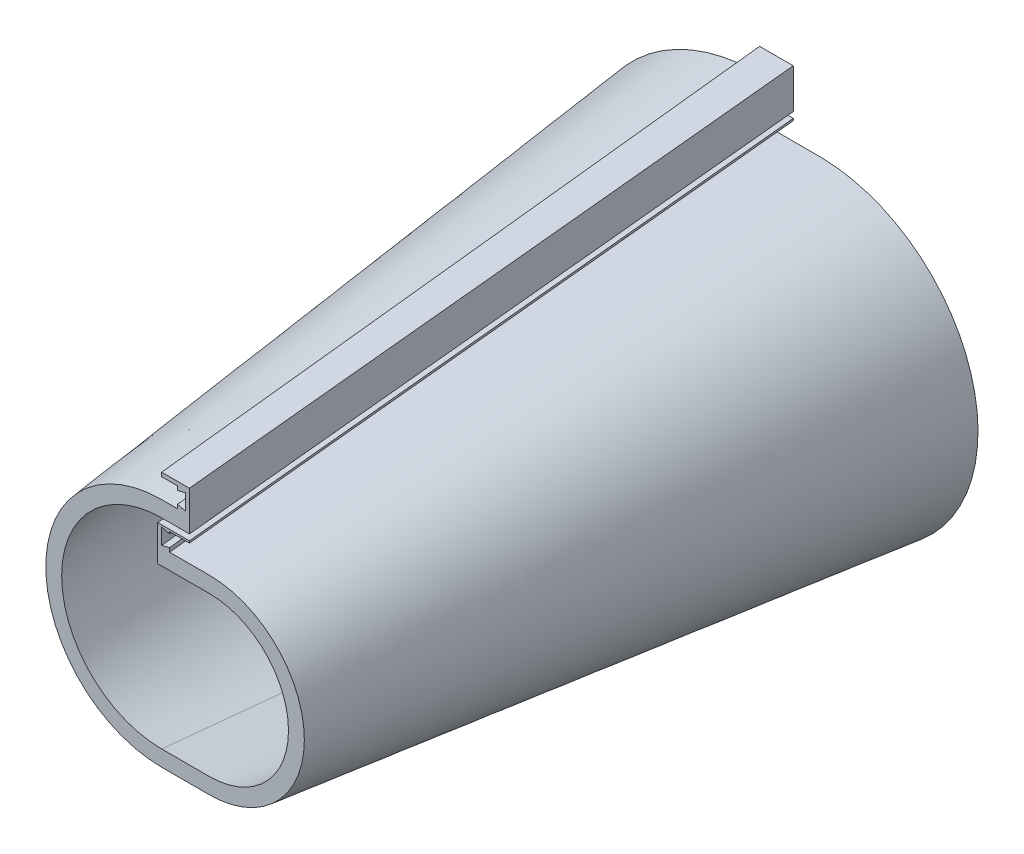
ISO-10303-21;
HEADER;
FILE_DESCRIPTION(('STEP AP214'),'2;1');
FILE_NAME('part.step','',(''),(''),'','','');
FILE_SCHEMA(('AUTOMOTIVE_DESIGN { 1 0 10303 214 1 1 1 1 }'));
ENDSEC;
DATA;
#1=APPLICATION_CONTEXT('core data for automotive mechanical design processes');
#2=APPLICATION_PROTOCOL_DEFINITION('international standard','automotive_design',2000,#1);
#3=PRODUCT_CONTEXT('',#1,'mechanical');
#4=PRODUCT('Part','Part','',(#3));
#5=PRODUCT_RELATED_PRODUCT_CATEGORY('part','',(#4));
#6=PRODUCT_DEFINITION_FORMATION('','',#4);
#7=PRODUCT_DEFINITION_CONTEXT('part definition',#1,'design');
#8=PRODUCT_DEFINITION('design','',#6,#7);
#9=PRODUCT_DEFINITION_SHAPE('','',#8);
#10=(LENGTH_UNIT() NAMED_UNIT(*) SI_UNIT(.MILLI.,.METRE.));
#11=(NAMED_UNIT(*) PLANE_ANGLE_UNIT() SI_UNIT($,.RADIAN.));
#12=(NAMED_UNIT(*) SI_UNIT($,.STERADIAN.) SOLID_ANGLE_UNIT());
#13=UNCERTAINTY_MEASURE_WITH_UNIT(LENGTH_MEASURE(1.E-05),#10,'distance_accuracy_value','');
#14=(GEOMETRIC_REPRESENTATION_CONTEXT(3) GLOBAL_UNCERTAINTY_ASSIGNED_CONTEXT((#13)) GLOBAL_UNIT_ASSIGNED_CONTEXT((#10,
#11,#12)) REPRESENTATION_CONTEXT('',''));
#15=CARTESIAN_POINT('',(0.,0.,0.));
#16=DIRECTION('',(0.,0.,1.));
#17=DIRECTION('',(1.,0.,0.));
#18=AXIS2_PLACEMENT_3D('',#15,#16,#17);
#19=CARTESIAN_POINT('',(0.,56.,-203.2));
#20=CARTESIAN_POINT('',(0.,34.5,0.));
#21=CARTESIAN_POINT('',(-0.666666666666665,56.,-203.2));
#22=CARTESIAN_POINT('',(-0.5,34.5,0.));
#23=CARTESIAN_POINT('',(-1.95951919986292,56.,-203.2));
#24=CARTESIAN_POINT('',(-1.53132183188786,34.5,0.));
#25=CARTESIAN_POINT('',(-3.86961363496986,56.,-203.2));
#26=CARTESIAN_POINT('',(-3.10344979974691,34.5,0.));
#27=CARTESIAN_POINT('',(-5.83110910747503,56.,-203.2));
#28=CARTESIAN_POINT('',(-4.61879209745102,34.5,0.));
#29=CARTESIAN_POINT('',(-7.23747988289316,56.,-203.2));
#30=CARTESIAN_POINT('',(-5.55419157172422,34.5,0.));
#31=CARTESIAN_POINT('',(-11.2976163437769,56.,-203.2));
#32=CARTESIAN_POINT('',(-7.9279559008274,34.5,0.));
#33=CARTESIAN_POINT('',(-17.9045072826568,55.355226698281,-203.2));
#34=CARTESIAN_POINT('',(-11.7770285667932,34.1177097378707,0.));
#35=CARTESIAN_POINT('',(-27.4672579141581,52.4711410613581,-203.2));
#36=CARTESIAN_POINT('',(-17.3100677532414,32.4297006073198,0.));
#37=CARTESIAN_POINT('',(-36.3072574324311,47.7666820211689,-203.2));
#38=CARTESIAN_POINT('',(-22.3943098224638,29.7006248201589,0.));
#39=CARTESIAN_POINT('',(-44.0742715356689,41.4126580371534,-203.2));
#40=CARTESIAN_POINT('',(-26.8404520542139,26.0404419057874,0.));
#41=CARTESIAN_POINT('',(-50.4578361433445,33.6491859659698,-203.2));
#42=CARTESIAN_POINT('',(-30.4841929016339,21.5920785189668,0.));
#43=CARTESIAN_POINT('',(-55.2015763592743,24.7756063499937,-203.2));
#44=CARTESIAN_POINT('',(-33.1914772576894,16.525871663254,0.));
#45=CARTESIAN_POINT('',(-58.1146751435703,15.1383684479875,-203.2));
#46=CARTESIAN_POINT('',(-34.8628625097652,11.0335745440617,0.));
#47=CARTESIAN_POINT('',(-59.0806329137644,5.1160987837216,-203.2));
#48=CARTESIAN_POINT('',(-35.4365865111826,5.32185405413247,0.));
#49=CARTESIAN_POINT('',(-58.0624425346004,-4.89666700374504,-203.2));
#50=CARTESIAN_POINT('',(-34.8906145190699,-0.39478979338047,0.));
#51=CARTESIAN_POINT('',(-55.1041346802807,-14.5066198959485,-203.2));
#52=CARTESIAN_POINT('',(-33.2434273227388,-5.90127585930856,0.));
#53=CARTESIAN_POINT('',(-50.3284516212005,-23.3386832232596,-203.2));
#54=CARTESIAN_POINT('',(-30.5535593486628,-10.9892239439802,0.));
#55=CARTESIAN_POINT('',(-43.9309687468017,-31.0519318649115,-203.2));
#56=CARTESIAN_POINT('',(-26.9178809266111,-15.4641754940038,0.));
#57=CARTESIAN_POINT('',(-36.1707708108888,-37.3539503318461,-203.2));
#58=CARTESIAN_POINT('',(-22.4687800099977,-19.1522824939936,0.));
#59=CARTESIAN_POINT('',(-27.3586245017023,-42.0122708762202,-203.2));
#60=CARTESIAN_POINT('',(-17.3700432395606,-21.9065785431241,0.));
#61=CARTESIAN_POINT('',(-17.8425168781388,-44.8636253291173,-203.2));
#62=CARTESIAN_POINT('',(-11.8117532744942,-23.612870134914,0.));
#63=CARTESIAN_POINT('',(-11.2761364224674,-45.5,-203.2));
#64=CARTESIAN_POINT('',(-7.94009975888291,-24.,0.));
#65=CARTESIAN_POINT('',(-6.4848935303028,-45.5,-203.2));
#66=CARTESIAN_POINT('',(-5.10276700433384,-24.,0.));
#67=CARTESIAN_POINT('',(-3.80022649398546,-45.5,-203.2));
#68=CARTESIAN_POINT('',(-3.16412231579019,-24.,0.));
#69=CARTESIAN_POINT('',(-0.0644247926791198,-45.5,-203.2));
#70=CARTESIAN_POINT('',(0.0762154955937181,-24.0000000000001,0.));
#71=CARTESIAN_POINT('',(3.69529819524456,-45.5,-203.2));
#72=CARTESIAN_POINT('',(3.26436056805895,-24.,0.));
#73=CARTESIAN_POINT('',(6.42740203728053,-45.5,-203.2));
#74=CARTESIAN_POINT('',(5.13527031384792,-24.,0.));
#75=CARTESIAN_POINT('',(10.9181518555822,-45.5,-203.2));
#76=CARTESIAN_POINT('',(7.60461389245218,-24.,0.));
#77=CARTESIAN_POINT('',(16.7762945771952,-44.9368037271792,-203.2));
#78=CARTESIAN_POINT('',(10.7996832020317,-23.6763848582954,0.));
#79=CARTESIAN_POINT('',(25.2927268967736,-42.3983416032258,-203.200000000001));
#80=CARTESIAN_POINT('',(15.3718957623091,-22.2667666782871,0.));
#81=CARTESIAN_POINT('',(33.2012781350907,-38.2339722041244,-203.2));
#82=CARTESIAN_POINT('',(19.5482487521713,-19.9952397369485,0.));
#83=CARTESIAN_POINT('',(40.1811250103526,-32.5814656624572,-203.2));
#84=CARTESIAN_POINT('',(23.1885771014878,-16.9724940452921,0.));
#85=CARTESIAN_POINT('',(45.942967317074,-25.6455470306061,-203.2));
#86=CARTESIAN_POINT('',(26.1527157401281,-13.3092196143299,0.));
#87=CARTESIAN_POINT('',(50.2440905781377,-17.6899611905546,-203.2));
#88=CARTESIAN_POINT('',(28.3513663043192,-9.15585541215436,0.));
#89=CARTESIAN_POINT('',(52.90105255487,-9.02634100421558,-203.2));
#90=CARTESIAN_POINT('',(29.6952304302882,-4.66284040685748,0.));
#91=CARTESIAN_POINT('',(53.799637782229,0.,-203.2));
#92=CARTESIAN_POINT('',(30.1534658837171,0.,0.));
#93=CARTESIAN_POINT('',(52.9010525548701,9.02634100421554,-203.2));
#94=CARTESIAN_POINT('',(29.6952304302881,4.6628404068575,0.));
#95=CARTESIAN_POINT('',(50.2440905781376,17.6899611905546,-203.2));
#96=CARTESIAN_POINT('',(28.3513663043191,9.15585541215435,0.));
#97=CARTESIAN_POINT('',(45.9429673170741,25.645547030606,-203.2));
#98=CARTESIAN_POINT('',(26.1527157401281,13.30921961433,0.));
#99=CARTESIAN_POINT('',(40.1811250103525,32.5814656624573,-203.2));
#100=CARTESIAN_POINT('',(23.1885771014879,16.9724940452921,0.));
#101=CARTESIAN_POINT('',(33.2012781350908,38.2339722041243,-203.2));
#102=CARTESIAN_POINT('',(19.5482487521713,19.9952397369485,0.));
#103=CARTESIAN_POINT('',(25.2927268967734,42.398341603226,-203.2));
#104=CARTESIAN_POINT('',(15.371895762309,22.266766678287,0.));
#105=CARTESIAN_POINT('',(16.7762945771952,44.9368037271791,-203.2));
#106=CARTESIAN_POINT('',(10.7996832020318,23.6763848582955,0.));
#107=CARTESIAN_POINT('',(10.9181518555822,45.5,-203.2));
#108=CARTESIAN_POINT('',(7.6046138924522,24.,0.));
#109=CARTESIAN_POINT('',(6.42740203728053,45.5,-203.2));
#110=CARTESIAN_POINT('',(5.13527031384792,24.,0.));
#111=CARTESIAN_POINT('',(3.5916079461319,45.5,-203.2));
#112=CARTESIAN_POINT('',(3.30303911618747,24.,0.));
#113=CARTESIAN_POINT('',(-0.313106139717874,45.5,-203.2));
#114=CARTESIAN_POINT('',(0.269867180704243,24.,0.));
#115=CARTESIAN_POINT('',(-4.09714466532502,45.5,-203.2));
#116=CARTESIAN_POINT('',(-2.9186453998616,24.,0.));
#117=CARTESIAN_POINT('',(-6.66666666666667,45.5,-203.2));
#118=CARTESIAN_POINT('',(-5.,24.,0.));
#119=CARTESIAN_POINT('',(-8.,45.5,-203.2));
#120=CARTESIAN_POINT('',(-6.,24.,0.));
#121=B_SPLINE_SURFACE_WITH_KNOTS('',3,1,((#19,#20),(#21,#22),(#23,#24),(#25,#26),(#27,#28),(#29,
#30),(#31,#32),(#33,#34),(#35,#36),(#37,#38),(#39,#40),(#41,#42),(#43,#44),(#45,#46),(#47,#48),
(#49,#50),(#51,#52),(#53,#54),(#55,#56),(#57,#58),(#59,#60),(#61,#62),(#63,#64),(#65,#66),(#67,
#68),(#69,#70),(#71,#72),(#73,#74),(#75,#76),(#77,#78),(#79,#80),(#81,#82),(#83,#84),(#85,#86),
(#87,#88),(#89,#90),(#91,#92),(#93,#94),(#95,#96),(#97,#98),(#99,#100),(#101,#102),(#103,#104),
(#105,#106),(#107,#108),(#109,#110),(#111,#112),(#113,#114),(#115,#116),(#117,#118),(#119,
#120)),.UNSPECIFIED.,.F.,.F.,.F.,(4,1,1,1,2,1,1,1,1,1,1,1,1,1,1,1,1,1,1,1,2,1,1,1,2,1,1,1,1,1,1,
1,1,1,1,1,1,1,1,1,2,1,1,1,4),(2,2),(0.,0.00673065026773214,0.0134613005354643,
0.0201919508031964,0.0269226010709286,0.0560301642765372,0.0851377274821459,0.114245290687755,
0.143352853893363,0.172460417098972,0.201567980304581,0.230675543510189,0.259783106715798,
0.288890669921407,0.317998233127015,0.347105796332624,0.376213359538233,0.405320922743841,
0.43442848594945,0.463536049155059,0.492643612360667,0.506104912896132,0.519566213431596,
0.53302751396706,0.546488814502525,0.571467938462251,0.596447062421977,0.621426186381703,
0.646405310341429,0.671384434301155,0.696363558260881,0.721342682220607,0.746321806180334,
0.77130093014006,0.796280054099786,0.821259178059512,0.846238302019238,0.871217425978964,
0.89619654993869,0.921175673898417,0.946154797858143,0.959616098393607,0.973077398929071,
0.986538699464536,1.),(0.,1.),.UNSPECIFIED.);
#122=CARTESIAN_POINT('',(-7.5,40.125,-152.4));
#123=CARTESIAN_POINT('',(-6.98486706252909,40.1249999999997,-152.4));
#124=CARTESIAN_POINT('',(-6.46973412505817,40.1249999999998,-152.4));
#125=CARTESIAN_POINT('',(-5.43849251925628,40.1250000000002,-152.4));
#126=CARTESIAN_POINT('',(-4.9223838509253,40.1250000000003,-152.4));
#127=CARTESIAN_POINT('',(-3.88938741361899,40.1249999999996,-152.4));
#128=CARTESIAN_POINT('',(-3.37249964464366,40.1249999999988,-152.4));
#129=CARTESIAN_POINT('',(-2.33814163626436,40.1250000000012,-152.4));
#130=CARTESIAN_POINT('',(-1.82067139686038,40.1250000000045,-152.4));
#131=CARTESIAN_POINT('',(-0.78534507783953,40.1249999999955,-152.4));
#132=CARTESIAN_POINT('',(-0.267488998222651,40.1249999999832,-152.4));
#133=CARTESIAN_POINT('',(0.768412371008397,40.1250000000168,-152.4));
#134=CARTESIAN_POINT('',(1.28645766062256,40.1250000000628,-152.4));
#135=CARTESIAN_POINT('',(2.06863137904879,40.124999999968,-152.4));
#136=CARTESIAN_POINT('',(2.33275980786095,40.1249999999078,-152.4));
#137=CARTESIAN_POINT('',(2.86101701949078,40.1250000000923,-152.4));
#138=CARTESIAN_POINT('',(3.12514580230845,40.1250000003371,-152.4));
#139=CARTESIAN_POINT('',(3.65333927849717,40.124999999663,-152.4));
#140=CARTESIAN_POINT('',(3.91740397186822,40.1249999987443,-152.4));
#141=CARTESIAN_POINT('',(4.44553203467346,40.1250000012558,-152.4));
#142=CARTESIAN_POINT('',(4.70959540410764,40.1250000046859,-152.4));
#143=CARTESIAN_POINT('',(5.23758021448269,40.1249999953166,-152.4));
#144=CARTESIAN_POINT('',(5.50150165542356,40.124999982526,-152.4));
#145=CARTESIAN_POINT('',(5.89738643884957,40.1250000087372,-152.4));
#146=CARTESIAN_POINT('',(6.02934978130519,40.1250000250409,-152.4));
#147=CARTESIAN_POINT('',(6.29327616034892,40.1249999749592,-152.4));
#148=CARTESIAN_POINT('',(6.42523919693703,40.1249999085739,-152.4));
#149=CARTESIAN_POINT('',(6.68905234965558,40.1250000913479,-152.4));
#150=CARTESIAN_POINT('',(6.82090246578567,40.1250003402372,-152.4));
#151=CARTESIAN_POINT('',(7.01867820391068,40.12499982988,-152.4));
#152=CARTESIAN_POINT('',(7.08460382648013,40.1249995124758,-152.4));
#153=CARTESIAN_POINT('',(7.21645508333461,40.1250004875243,-152.4));
#154=CARTESIAN_POINT('',(7.28238071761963,40.1250017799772,-152.4));
#155=CARTESIAN_POINT('',(7.38126818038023,40.1249991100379,-152.4));
#156=CARTESIAN_POINT('',(7.41423001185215,40.1249974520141,-152.4));
#157=CARTESIAN_POINT('',(7.48015367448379,40.1250025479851,-152.4));
#158=CARTESIAN_POINT('',(7.51311550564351,40.125009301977,-152.4));
#159=CARTESIAN_POINT('',(7.61200062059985,40.1249017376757,-152.4));
#160=CARTESIAN_POINT('',(7.67792383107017,40.1246595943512,-152.4));
#161=CARTESIAN_POINT('',(7.80976707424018,40.1238533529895,-152.4));
#162=CARTESIAN_POINT('',(7.87568710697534,40.1232892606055,-152.4));
#163=CARTESIAN_POINT('',(8.00752383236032,40.121834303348,-152.4));
#164=CARTESIAN_POINT('',(8.07344052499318,40.1209434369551,-152.4));
#165=CARTESIAN_POINT('',(8.27104537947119,40.1177849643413,-152.4));
#166=CARTESIAN_POINT('',(8.40272610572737,40.1150306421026,-152.4));
#167=CARTESIAN_POINT('',(8.66605589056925,40.108223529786,-152.4));
#168=CARTESIAN_POINT('',(8.79770494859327,40.1041707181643,-152.4));
#169=CARTESIAN_POINT('',(9.06096174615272,40.0947680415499,-152.4));
#170=CARTESIAN_POINT('',(9.19256948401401,40.0894181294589,-152.4));
#171=CARTESIAN_POINT('',(9.45572531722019,40.0774226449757,-152.4));
#172=CARTESIAN_POINT('',(9.58727341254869,40.0707770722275,-152.4));
#173=CARTESIAN_POINT('',(9.98181135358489,40.0488986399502,-152.4));
#174=CARTESIAN_POINT('',(10.2446968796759,40.0317239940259,-152.4));
#175=CARTESIAN_POINT('',(10.7700802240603,39.9922077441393,-152.4));
#176=CARTESIAN_POINT('',(11.0325780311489,39.9698659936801,-152.4));
#177=CARTESIAN_POINT('',(11.8579294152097,39.8914366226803,-152.4));
#178=CARTESIAN_POINT('',(12.4199292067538,39.8260365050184,-152.4));
#179=CARTESIAN_POINT('',(13.5410570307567,39.6715096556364,-152.4));
#180=CARTESIAN_POINT('',(14.1001826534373,39.5823655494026,-152.4));
#181=CARTESIAN_POINT('',(15.2143733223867,39.380411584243,-152.4));
#182=CARTESIAN_POINT('',(15.7694367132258,39.2675925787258,-152.4));
#183=CARTESIAN_POINT('',(16.8743106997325,39.0185363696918,-152.4));
#184=CARTESIAN_POINT('',(17.4241210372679,38.8822980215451,-152.4));
#185=CARTESIAN_POINT('',(18.5134454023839,38.5878028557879,-152.4));
#186=CARTESIAN_POINT('',(19.0530055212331,38.4297165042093,-152.4));
#187=CARTESIAN_POINT('',(20.124950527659,38.0910662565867,-152.4));
#188=CARTESIAN_POINT('',(20.6573363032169,37.9105051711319,-152.4));
#189=CARTESIAN_POINT('',(21.7140133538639,37.527175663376,-152.4));
#190=CARTESIAN_POINT('',(22.2383052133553,37.3244088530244,-152.4));
#191=CARTESIAN_POINT('',(23.2778518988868,36.8969468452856,-152.4));
#192=CARTESIAN_POINT('',(23.7931068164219,36.6722518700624,-152.4));
#193=CARTESIAN_POINT('',(24.9850688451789,36.122360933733,-152.4));
#194=CARTESIAN_POINT('',(25.6579128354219,35.7887476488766,-152.4));
#195=CARTESIAN_POINT('',(26.9838714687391,35.084386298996,-152.4));
#196=CARTESIAN_POINT('',(27.6369855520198,34.7136371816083,-152.4));
#197=CARTESIAN_POINT('',(28.9214164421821,33.9360943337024,-152.4));
#198=CARTESIAN_POINT('',(29.5527330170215,33.5293002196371,-152.4));
#199=CARTESIAN_POINT('',(30.7937184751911,32.6793920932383,-152.4));
#200=CARTESIAN_POINT('',(31.4033021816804,32.2361537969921,-152.4));
#201=CARTESIAN_POINT('',(32.5966466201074,31.3161080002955,-152.4));
#202=CARTESIAN_POINT('',(33.1804072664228,30.839300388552,-152.4));
#203=CARTESIAN_POINT('',(34.0351441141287,30.1001206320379,-152.4));
#204=CARTESIAN_POINT('',(34.3165692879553,29.8497356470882,-152.4));
#205=CARTESIAN_POINT('',(34.8723195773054,29.3410771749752,-152.4));
#206=CARTESIAN_POINT('',(35.1466431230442,29.0828019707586,-152.4));
#207=CARTESIAN_POINT('',(35.8228691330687,28.4278457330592,-152.4));
#208=CARTESIAN_POINT('',(36.220158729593,28.0263847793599,-152.4));
#209=CARTESIAN_POINT('',(36.9974465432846,27.2069786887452,-152.4));
#210=CARTESIAN_POINT('',(37.3774425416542,26.7890314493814,-152.4));
#211=CARTESIAN_POINT('',(38.1195145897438,25.9374458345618,-152.4));
#212=CARTESIAN_POINT('',(38.4815889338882,25.503805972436,-152.4));
#213=CARTESIAN_POINT('',(39.1871276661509,24.6216775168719,-152.4));
#214=CARTESIAN_POINT('',(39.5305928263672,24.1731895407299,-152.4));
#215=CARTESIAN_POINT('',(40.1978584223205,23.2627199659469,-152.4));
#216=CARTESIAN_POINT('',(40.5216845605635,22.8007572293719,-152.4));
#217=CARTESIAN_POINT('',(41.149519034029,21.8635970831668,-152.4));
#218=CARTESIAN_POINT('',(41.4535267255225,21.3883992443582,-152.4));
#219=CARTESIAN_POINT('',(42.3351200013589,19.9442084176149,-152.4));
#220=CARTESIAN_POINT('',(42.8824403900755,18.9563934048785,-152.4));
#221=CARTESIAN_POINT('',(43.6394746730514,17.4431581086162,-152.4));
#222=CARTESIAN_POINT('',(43.8811900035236,16.9334233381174,-152.4));
#223=CARTESIAN_POINT('',(44.3428678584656,15.9041897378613,-152.4));
#224=CARTESIAN_POINT('',(44.5628309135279,15.3846911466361,-152.4));
#225=CARTESIAN_POINT('',(45.1894302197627,13.8129845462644,-152.4));
#226=CARTESIAN_POINT('',(45.5628819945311,12.747355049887,-152.4));
#227=CARTESIAN_POINT('',(46.2190162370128,10.5881219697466,-152.4));
#228=CARTESIAN_POINT('',(46.5016691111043,9.49450939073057,-152.4));
#229=CARTESIAN_POINT('',(46.8556685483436,7.8393931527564,-152.4));
#230=CARTESIAN_POINT('',(46.9620129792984,7.28517574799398,-152.4));
#231=CARTESIAN_POINT('',(47.1512345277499,6.17271206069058,-152.4));
#232=CARTESIAN_POINT('',(47.234111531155,5.61446575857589,-152.4));
#233=CARTESIAN_POINT('',(47.3762420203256,4.49539000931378,-152.4));
#234=CARTESIAN_POINT('',(47.4355123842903,3.93456269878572,-152.4));
#235=CARTESIAN_POINT('',(47.530402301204,2.81090977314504,-152.4));
#236=CARTESIAN_POINT('',(47.5660219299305,2.24808416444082,-152.4));
#237=CARTESIAN_POINT('',(47.6134954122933,1.12143313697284,-152.4));
#238=CARTESIAN_POINT('',(47.6253493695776,0.55760772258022,-152.4));
#239=CARTESIAN_POINT('',(47.6251740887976,-0.570039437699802,-152.4));
#240=CARTESIAN_POINT('',(47.6131448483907,-1.13386118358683,-152.4));
#241=CARTESIAN_POINT('',(47.5653188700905,-2.26056876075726,-152.4));
#242=CARTESIAN_POINT('',(47.5295190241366,-2.8234544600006,-152.4));
#243=CARTESIAN_POINT('',(47.4342634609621,-3.94721953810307,-152.4));
#244=CARTESIAN_POINT('',(47.3748076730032,-4.50809891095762,-152.4));
#245=CARTESIAN_POINT('',(47.2323512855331,-5.62687687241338,-152.4));
#246=CARTESIAN_POINT('',(47.1493503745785,-6.18477542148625,-152.4));
#247=CARTESIAN_POINT('',(46.959908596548,-7.29654125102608,-152.4));
#248=CARTESIAN_POINT('',(46.8534678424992,-7.85040855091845,-152.4));
#249=CARTESIAN_POINT('',(46.499104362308,-9.50502579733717,-152.4));
#250=CARTESIAN_POINT('',(46.2161801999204,-10.5984786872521,-152.4));
#251=CARTESIAN_POINT('',(45.5594211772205,-12.7577104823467,-152.4));
#252=CARTESIAN_POINT('',(45.185587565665,-13.8234897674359,-152.4));
#253=CARTESIAN_POINT('',(44.5585682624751,-15.3949441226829,-152.4));
#254=CARTESIAN_POINT('',(44.3385974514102,-15.9140657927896,-152.4));
#255=CARTESIAN_POINT('',(43.8769314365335,-16.9425540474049,-152.4));
#256=CARTESIAN_POINT('',(43.6352357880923,-17.4519204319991,-152.4));
#257=CARTESIAN_POINT('',(42.8782956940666,-18.9640931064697,-152.4));
#258=CARTESIAN_POINT('',(42.3311069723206,-19.9512010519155,-152.4));
#259=CARTESIAN_POINT('',(41.3519986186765,-21.5544371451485,-152.4));
#260=CARTESIAN_POINT('',(40.9425292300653,-22.184460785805,-152.4));
#261=CARTESIAN_POINT('',(40.0887861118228,-23.4205412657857,-152.4));
#262=CARTESIAN_POINT('',(39.6445127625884,-24.0265983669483,-152.4));
#263=CARTESIAN_POINT('',(38.7227375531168,-25.2128367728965,-152.4));
#264=CARTESIAN_POINT('',(38.2452366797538,-25.7930188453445,-152.4));
#265=CARTESIAN_POINT('',(37.2571377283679,-26.9272411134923,-152.4));
#266=CARTESIAN_POINT('',(36.7464541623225,-27.4812068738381,-152.4));
#267=CARTESIAN_POINT('',(35.6946005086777,-28.5594135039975,-152.4));
#268=CARTESIAN_POINT('',(35.1534297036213,-29.0836536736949,-152.4));
#269=CARTESIAN_POINT('',(34.0423446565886,-30.1008563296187,-152.4));
#270=CARTESIAN_POINT('',(33.4724281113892,-30.5938163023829,-152.4));
#271=CARTESIAN_POINT('',(32.4509472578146,-31.4283766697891,-152.4));
#272=CARTESIAN_POINT('',(32.0052012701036,-31.7771285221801,-152.4));
#273=CARTESIAN_POINT('',(31.0993777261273,-32.4555084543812,-152.4));
#274=CARTESIAN_POINT('',(30.6393003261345,-32.7851367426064,-152.4));
#275=CARTESIAN_POINT('',(29.7056539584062,-33.4245809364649,-152.4));
#276=CARTESIAN_POINT('',(29.2320864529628,-33.734398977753,-152.4));
#277=CARTESIAN_POINT('',(28.2723663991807,-34.3336646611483,-152.4));
#278=CARTESIAN_POINT('',(27.7862164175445,-34.6231164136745,-152.4));
#279=CARTESIAN_POINT('',(26.8055288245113,-35.1793257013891,-152.4));
#280=CARTESIAN_POINT('',(26.3110721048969,-35.4462258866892,-152.4));
#281=CARTESIAN_POINT('',(25.3113864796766,-35.9590759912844,-152.4));
#282=CARTESIAN_POINT('',(24.8061571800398,-36.2050251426,-152.4));
#283=CARTESIAN_POINT('',(23.7856742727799,-36.6755524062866,-152.4));
#284=CARTESIAN_POINT('',(23.2704179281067,-36.9001245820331,-152.4));
#285=CARTESIAN_POINT('',(22.2306074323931,-37.3274515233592,-152.4));
#286=CARTESIAN_POINT('',(21.7060484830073,-37.5301946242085,-152.4));
#287=CARTESIAN_POINT('',(20.7551706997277,-37.8749085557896,-152.4));
#288=CARTESIAN_POINT('',(20.3303045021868,-38.0209024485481,-152.4));
#289=CARTESIAN_POINT('',(19.4758983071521,-38.2985635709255,-152.4));
#290=CARTESIAN_POINT('',(19.0463581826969,-38.4302304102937,-152.4));
#291=CARTESIAN_POINT('',(18.183243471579,-38.6790498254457,-152.4));
#292=CARTESIAN_POINT('',(17.7496702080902,-38.7962069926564,-152.4));
#293=CARTESIAN_POINT('',(16.8791271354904,-39.0158438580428,-152.4));
#294=CARTESIAN_POINT('',(16.4421597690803,-39.1183332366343,-152.4));
#295=CARTESIAN_POINT('',(15.5654708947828,-39.3084780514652,-152.4));
#296=CARTESIAN_POINT('',(15.1257526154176,-39.3961483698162,-152.4));
#297=CARTESIAN_POINT('',(14.2386750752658,-39.5575734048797,-152.4));
#298=CARTESIAN_POINT('',(13.7912854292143,-39.6311610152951,-152.4));
#299=CARTESIAN_POINT('',(12.8942655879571,-39.76314516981,-152.4));
#300=CARTESIAN_POINT('',(12.4446354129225,-39.82154185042,-152.4));
#301=CARTESIAN_POINT('',(11.7688533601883,-39.8977083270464,-152.4));
#302=CARTESIAN_POINT('',(11.5433317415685,-39.921195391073,-152.4));
#303=CARTESIAN_POINT('',(11.091918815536,-39.9643500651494,-152.4));
#304=CARTESIAN_POINT('',(10.8660275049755,-39.9840176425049,-152.4));
#305=CARTESIAN_POINT('',(10.4138041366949,-40.0195371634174,-152.4));
#306=CARTESIAN_POINT('',(10.1874718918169,-40.0353867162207,-152.4));
#307=CARTESIAN_POINT('',(9.73457361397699,-40.0632475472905,-152.4));
#308=CARTESIAN_POINT('',(9.50800758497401,-40.0752588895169,-152.4));
#309=CARTESIAN_POINT('',(9.16792565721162,-40.0903973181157,-152.4));
#310=CARTESIAN_POINT('',(9.05447211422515,-40.0949651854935,-152.4));
#311=CARTESIAN_POINT('',(8.82752934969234,-40.1031367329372,-152.4));
#312=CARTESIAN_POINT('',(8.71404012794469,-40.1067404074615,-152.4));
#313=CARTESIAN_POINT('',(8.48703412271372,-40.1129846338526,-152.4));
#314=CARTESIAN_POINT('',(8.3735173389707,-40.1156251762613,-152.4));
#315=CARTESIAN_POINT('',(8.1464668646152,-40.1199349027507,-152.4));
#316=CARTESIAN_POINT('',(8.03293317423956,-40.1216040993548,-152.4));
#317=CARTESIAN_POINT('',(7.82625205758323,-40.1237826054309,-152.4));
#318=CARTESIAN_POINT('',(7.73310628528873,-40.1244464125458,-152.4));
#319=CARTESIAN_POINT('',(7.54681210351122,-40.1250636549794,-152.4));
#320=CARTESIAN_POINT('',(7.45366369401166,-40.1250170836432,-152.4));
#321=CARTESIAN_POINT('',(7.26736559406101,-40.1249829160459,-152.4));
#322=CARTESIAN_POINT('',(7.17421590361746,-40.1249953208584,-152.4));
#323=CARTESIAN_POINT('',(6.98791680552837,-40.1250046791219,-152.4));
#324=CARTESIAN_POINT('',(6.89476739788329,-40.1250016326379,-152.4));
#325=CARTESIAN_POINT('',(6.61531407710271,-40.1249967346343,-152.4));
#326=CARTESIAN_POINT('',(6.42901019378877,-40.1249991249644,-152.4));
#327=CARTESIAN_POINT('',(6.05640410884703,-40.1250008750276,-152.4));
#328=CARTESIAN_POINT('',(5.87010190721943,-40.1250002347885,-152.4));
#329=CARTESIAN_POINT('',(5.49758028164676,-40.1249997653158,-152.4));
#330=CARTESIAN_POINT('',(5.31136085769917,-40.124999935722,-152.4));
#331=CARTESIAN_POINT('',(4.93892155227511,-40.1250000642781,-152.4));
#332=CARTESIAN_POINT('',(4.75270167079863,-40.1250000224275,-152.4));
#333=CARTESIAN_POINT('',(4.19404673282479,-40.1249999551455,-152.4));
#334=CARTESIAN_POINT('',(3.82161167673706,-40.1249999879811,-152.4));
#335=CARTESIAN_POINT('',(3.07671831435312,-40.1250000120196,-152.4));
#336=CARTESIAN_POINT('',(2.7042600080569,-40.1250000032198,-152.4));
#337=CARTESIAN_POINT('',(1.959342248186,-40.1249999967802,-152.4));
#338=CARTESIAN_POINT('',(1.58688279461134,-40.1249999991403,-152.4));
#339=CARTESIAN_POINT('',(0.841758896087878,-40.1250000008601,-152.4));
#340=CARTESIAN_POINT('',(0.469094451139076,-40.1250000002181,-152.4));
#341=CARTESIAN_POINT('',(-0.276234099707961,-40.1249999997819,-152.4));
#342=CARTESIAN_POINT('',(-0.648898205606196,-40.1249999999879,-152.4));
#343=CARTESIAN_POINT('',(-1.39461557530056,-40.1250000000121,-152.4));
#344=CARTESIAN_POINT('',(-1.76766883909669,-40.12499999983,-152.4));
#345=CARTESIAN_POINT('',(-2.51377557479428,-40.12500000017,-152.4));
#346=CARTESIAN_POINT('',(-2.88682904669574,-40.125000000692,-152.4));
#347=CARTESIAN_POINT('',(-3.63350892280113,-40.1249999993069,-152.4));
#348=CARTESIAN_POINT('',(-4.00713532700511,-40.124999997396,-152.4));
#349=CARTESIAN_POINT('',(-4.56757473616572,-40.125000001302,-152.4));
#350=CARTESIAN_POINT('',(-4.7543877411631,-40.1250000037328,-152.4));
#351=CARTESIAN_POINT('',(-5.12801365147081,-40.1249999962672,-152.4));
#352=CARTESIAN_POINT('',(-5.31482655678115,-40.1249999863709,-152.4));
#353=CARTESIAN_POINT('',(-5.68736860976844,-40.12500001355,-152.4));
#354=CARTESIAN_POINT('',(-5.87309775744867,-40.1250000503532,-152.4));
#355=CARTESIAN_POINT('',(-6.24455642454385,-40.1249999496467,-152.4));
#356=CARTESIAN_POINT('',(-6.4302859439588,-40.1249998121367,-152.4));
#357=CARTESIAN_POINT('',(-6.70888089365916,-40.1250000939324,-152.4));
#358=CARTESIAN_POINT('',(-6.80174632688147,-40.1250002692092,-152.4));
#359=CARTESIAN_POINT('',(-6.98747737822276,-40.1249997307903,-152.4));
#360=CARTESIAN_POINT('',(-7.08034299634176,-40.1249990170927,-152.4));
#361=CARTESIAN_POINT('',(-7.26607386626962,-40.1250009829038,-152.4));
#362=CARTESIAN_POINT('',(-7.35893911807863,-40.1250036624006,-152.4));
#363=CARTESIAN_POINT('',(-7.49823695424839,-40.1249981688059,-152.4));
#364=CARTESIAN_POINT('',(-7.54466948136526,-40.1249947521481,-152.4));
#365=CARTESIAN_POINT('',(-7.63753421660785,-40.124821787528,-152.4));
#366=CARTESIAN_POINT('',(-7.68396642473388,-40.1246522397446,-152.4));
#367=CARTESIAN_POINT('',(-7.82313579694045,-40.1239362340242,-152.4));
#368=CARTESIAN_POINT('',(-7.91587197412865,-40.1231825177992,-152.4));
#369=CARTESIAN_POINT('',(-8.10133821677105,-40.1211009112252,-152.4));
#370=CARTESIAN_POINT('',(-8.19406828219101,-40.1197730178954,-152.4));
#371=CARTESIAN_POINT('',(-8.47224313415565,-40.1149364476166,-152.4));
#372=CARTESIAN_POINT('',(-8.65767380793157,-40.1105748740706,-152.4));
#373=CARTESIAN_POINT('',(-9.02845981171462,-40.0995761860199,-152.4));
#374=CARTESIAN_POINT('',(-9.21381514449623,-40.0929391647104,-152.4));
#375=CARTESIAN_POINT('',(-9.58443057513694,-40.0773933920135,-152.4));
#376=CARTESIAN_POINT('',(-9.76969067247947,-40.0684846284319,-152.4));
#377=CARTESIAN_POINT('',(-10.3242365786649,-40.0384111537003,-152.4));
#378=CARTESIAN_POINT('',(-10.693345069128,-40.0138678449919,-152.4));
#379=CARTESIAN_POINT('',(-11.4308665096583,-39.9557753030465,-152.4));
#380=CARTESIAN_POINT('',(-11.7992794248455,-39.922225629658,-152.4));
#381=CARTESIAN_POINT('',(-12.5344657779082,-39.8462150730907,-152.4));
#382=CARTESIAN_POINT('',(-12.901241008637,-39.803771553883,-152.4));
#383=CARTESIAN_POINT('',(-13.6336384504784,-39.709956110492,-152.4));
#384=CARTESIAN_POINT('',(-13.9992606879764,-39.6585843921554,-152.4));
#385=CARTESIAN_POINT('',(-14.7287684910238,-39.5469900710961,-152.4));
#386=CARTESIAN_POINT('',(-15.0926554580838,-39.486776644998,-152.4));
#387=CARTESIAN_POINT('',(-15.8188447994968,-39.3574792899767,-152.4));
#388=CARTESIAN_POINT('',(-16.1811471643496,-39.2883953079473,-152.4));
#389=CARTESIAN_POINT('',(-17.2652306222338,-39.0679079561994,-152.4));
#390=CARTESIAN_POINT('',(-17.9843572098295,-38.9032433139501,-152.4));
#391=CARTESIAN_POINT('',(-19.5209860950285,-38.5117607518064,-152.4));
#392=CARTESIAN_POINT('',(-20.3370577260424,-38.2793240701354,-152.4));
#393=CARTESIAN_POINT('',(-21.9569190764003,-37.7685372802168,-152.4));
#394=CARTESIAN_POINT('',(-22.7606734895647,-37.4900752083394,-152.4));
#395=CARTESIAN_POINT('',(-24.3517684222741,-36.8881655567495,-152.4));
#396=CARTESIAN_POINT('',(-25.1390977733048,-36.5646884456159,-152.4));
#397=CARTESIAN_POINT('',(-26.6952921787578,-35.8734747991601,-152.4));
#398=CARTESIAN_POINT('',(-27.4641320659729,-35.5056816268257,-152.4));
#399=CARTESIAN_POINT('',(-28.9791746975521,-34.7278713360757,-152.4));
#400=CARTESIAN_POINT('',(-29.7253998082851,-34.3178978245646,-152.4));
#401=CARTESIAN_POINT('',(-31.1933694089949,-33.4568348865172,-152.4));
#402=CARTESIAN_POINT('',(-31.9151207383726,-33.0057570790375,-152.4));
#403=CARTESIAN_POINT('',(-33.6857719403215,-31.8283780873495,-152.4));
#404=CARTESIAN_POINT('',(-34.7182422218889,-31.0770414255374,-152.4));
#405=CARTESIAN_POINT('',(-36.2166587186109,-29.8871181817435,-152.4));
#406=CARTESIAN_POINT('',(-36.7078847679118,-29.4798632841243,-152.4));
#407=CARTESIAN_POINT('',(-37.6727889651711,-28.6450063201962,-152.4));
#408=CARTESIAN_POINT('',(-38.1464674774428,-28.2174046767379,-152.4));
#409=CARTESIAN_POINT('',(-39.0753302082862,-27.3425938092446,-152.4));
#410=CARTESIAN_POINT('',(-39.5305146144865,-26.8953847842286,-152.4));
#411=CARTESIAN_POINT('',(-40.4215794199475,-25.982121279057,-152.4));
#412=CARTESIAN_POINT('',(-40.8574596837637,-25.5160666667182,-152.4));
#413=CARTESIAN_POINT('',(-41.7091533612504,-24.5660710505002,-152.4));
#414=CARTESIAN_POINT('',(-42.1249691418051,-24.0821321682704,-152.4));
#415=CARTESIAN_POINT('',(-42.9358633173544,-23.0971827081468,-152.4));
#416=CARTESIAN_POINT('',(-43.330941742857,-22.5961721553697,-152.4));
#417=CARTESIAN_POINT('',(-44.0997243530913,-21.5778501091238,-152.4));
#418=CARTESIAN_POINT('',(-44.4734241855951,-21.0605353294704,-152.4));
#419=CARTESIAN_POINT('',(-45.1986124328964,-20.0105690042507,-152.4));
#420=CARTESIAN_POINT('',(-45.5501008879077,-19.4779174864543,-152.4));
#421=CARTESIAN_POINT('',(-46.2302949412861,-18.3982254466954,-152.4));
#422=CARTESIAN_POINT('',(-46.5589997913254,-17.8511844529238,-152.4));
#423=CARTESIAN_POINT('',(-47.1930695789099,-16.7437828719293,-152.4));
#424=CARTESIAN_POINT('',(-47.4984344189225,-16.1834222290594,-152.4));
#425=CARTESIAN_POINT('',(-48.3785804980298,-14.4840702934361,-152.4));
#426=CARTESIAN_POINT('',(-48.9177006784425,-13.3263526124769,-152.4));
#427=CARTESIAN_POINT('',(-49.8961724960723,-10.9695126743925,-152.4));
#428=CARTESIAN_POINT('',(-50.3355252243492,-9.77039087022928,-152.4));
#429=CARTESIAN_POINT('',(-50.9176359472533,-7.94775763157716,-152.4));
#430=CARTESIAN_POINT('',(-51.0988385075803,-7.33628530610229,-152.4));
#431=CARTESIAN_POINT('',(-51.4353617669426,-6.10622031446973,-152.4));
#432=CARTESIAN_POINT('',(-51.5906825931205,-5.4876276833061,-152.4));
#433=CARTESIAN_POINT('',(-51.8750741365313,-4.24444411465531,-152.4));
#434=CARTESIAN_POINT('',(-52.0041447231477,-3.61985314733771,-152.4));
#435=CARTESIAN_POINT('',(-52.235783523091,-2.36577200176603,-152.4));
#436=CARTESIAN_POINT('',(-52.3383516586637,-1.73628180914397,-152.4));
#437=CARTESIAN_POINT('',(-52.5169083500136,-0.473470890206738,-152.4));
#438=CARTESIAN_POINT('',(-52.5928938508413,0.159850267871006,-152.4));
#439=CARTESIAN_POINT('',(-52.7181488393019,1.42912876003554,-152.4));
#440=CARTESIAN_POINT('',(-52.7674183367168,2.06508609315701,-152.4));
#441=CARTESIAN_POINT('',(-52.8391344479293,3.33851458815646,-152.4));
#442=CARTESIAN_POINT('',(-52.8615810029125,3.97598575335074,-152.4));
#443=CARTESIAN_POINT('',(-52.8795100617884,5.25130350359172,-152.4));
#444=CARTESIAN_POINT('',(-52.8749926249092,5.88915008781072,-152.4));
#445=CARTESIAN_POINT('',(-52.8390434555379,7.1641778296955,-152.4));
#446=CARTESIAN_POINT('',(-52.807608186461,7.80135888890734,-152.4));
#447=CARTESIAN_POINT('',(-52.7179531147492,9.07379542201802,-152.4));
#448=CARTESIAN_POINT('',(-52.6597331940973,9.70905088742,-152.4));
#449=CARTESIAN_POINT('',(-52.4450429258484,11.6102390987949,-152.4));
#450=CARTESIAN_POINT('',(-52.2485339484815,12.8718796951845,-152.4));
#451=CARTESIAN_POINT('',(-51.7496612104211,15.3738283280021,-152.4));
#452=CARTESIAN_POINT('',(-51.4473157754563,16.6141400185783,-152.4));
#453=CARTESIAN_POINT('',(-50.9165387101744,18.4519688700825,-152.4));
#454=CARTESIAN_POINT('',(-50.7267110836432,19.0608719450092,-152.4));
#455=CARTESIAN_POINT('',(-50.3215871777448,20.2701863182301,-152.4));
#456=CARTESIAN_POINT('',(-50.106291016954,20.8705976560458,-152.4));
#457=CARTESIAN_POINT('',(-49.650474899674,22.0619888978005,-152.4));
#458=CARTESIAN_POINT('',(-49.4099464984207,22.6529655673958,-152.4));
#459=CARTESIAN_POINT('',(-48.9041228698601,23.8242272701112,-152.4));
#460=CARTESIAN_POINT('',(-48.6388275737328,24.404512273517,-152.4));
#461=CARTESIAN_POINT('',(-48.0840337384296,25.5533943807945,-152.4));
#462=CARTESIAN_POINT('',(-47.7945351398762,26.1219914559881,-152.4));
#463=CARTESIAN_POINT('',(-47.1918621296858,27.2464965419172,-152.4));
#464=CARTESIAN_POINT('',(-46.8786877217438,27.8024045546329,-152.4));
#465=CARTESIAN_POINT('',(-46.2290420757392,28.9008079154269,-152.4));
#466=CARTESIAN_POINT('',(-45.8925594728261,29.4432965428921,-152.4));
#467=CARTESIAN_POINT('',(-45.1969516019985,30.5135530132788,-152.4));
#468=CARTESIAN_POINT('',(-44.8378263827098,31.0413208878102,-152.4));
#469=CARTESIAN_POINT('',(-44.0976073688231,32.0812170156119,-152.4));
#470=CARTESIAN_POINT('',(-43.7165139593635,32.593345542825,-152.4));
#471=CARTESIAN_POINT('',(-42.933122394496,33.6010693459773,-152.4));
#472=CARTESIAN_POINT('',(-42.5308241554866,34.0966645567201,-152.4));
#473=CARTESIAN_POINT('',(-41.2932593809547,35.5572435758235,-152.4));
#474=CARTESIAN_POINT('',(-40.4270925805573,36.496344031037,-152.4));
#475=CARTESIAN_POINT('',(-38.6184252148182,38.2980057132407,-152.4));
#476=CARTESIAN_POINT('',(-37.6759208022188,39.1605630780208,-152.4));
#477=CARTESIAN_POINT('',(-36.2111254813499,40.3919656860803,-152.4));
#478=CARTESIAN_POINT('',(-35.7146204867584,40.7918393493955,-152.4));
#479=CARTESIAN_POINT('',(-34.7051872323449,41.5703814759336,-152.4));
#480=CARTESIAN_POINT('',(-34.1922586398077,41.9490495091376,-152.4));
#481=CARTESIAN_POINT('',(-33.1509544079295,42.6843576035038,-152.4));
#482=CARTESIAN_POINT('',(-32.622580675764,43.041000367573,-152.4));
#483=CARTESIAN_POINT('',(-31.5512904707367,43.7316236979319,-152.4));
#484=CARTESIAN_POINT('',(-31.0083753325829,44.0656063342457,-152.4));
#485=CARTESIAN_POINT('',(-29.909441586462,44.7101595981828,-152.4));
#486=CARTESIAN_POINT('',(-29.3534344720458,45.0207498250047,-152.4));
#487=CARTESIAN_POINT('',(-28.2288419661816,45.6183080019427,-152.4));
#488=CARTESIAN_POINT('',(-27.6602561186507,45.9052750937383,-152.4));
#489=CARTESIAN_POINT('',(-26.5113939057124,46.4551133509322,-152.4));
#490=CARTESIAN_POINT('',(-25.9311149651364,46.7179791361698,-152.4));
#491=CARTESIAN_POINT('',(-24.7597330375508,47.219090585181,-152.4));
#492=CARTESIAN_POINT('',(-24.1686256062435,47.4573258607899,-152.4));
#493=CARTESIAN_POINT('',(-22.97534442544,47.9092513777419,-152.4));
#494=CARTESIAN_POINT('',(-22.3731458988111,48.1228761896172,-152.4));
#495=CARTESIAN_POINT('',(-21.1603182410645,48.5245351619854,-152.4));
#496=CARTESIAN_POINT('',(-20.5496896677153,48.7125710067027,-152.4));
#497=CARTESIAN_POINT('',(-19.3213866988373,49.0626402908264,-152.4));
#498=CARTESIAN_POINT('',(-18.7037163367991,49.2246878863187,-152.4));
#499=CARTESIAN_POINT('',(-17.4627175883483,49.5224197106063,-152.4));
#500=CARTESIAN_POINT('',(-16.8393956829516,49.6581309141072,-152.4));
#501=CARTESIAN_POINT('',(-15.6801904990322,49.8849463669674,-152.4));
#502=CARTESIAN_POINT('',(-15.1450132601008,49.9796795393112,-152.4));
#503=CARTESIAN_POINT('',(-14.0715814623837,50.1498603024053,-152.4));
#504=CARTESIAN_POINT('',(-13.5333268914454,50.2253078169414,-152.4));
#505=CARTESIAN_POINT('',(-12.7240555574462,50.3239773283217,-152.4));
#506=CARTESIAN_POINT('',(-12.4539039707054,50.3544570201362,-152.4));
#507=CARTESIAN_POINT('',(-11.9130960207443,50.4105642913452,-152.4));
#508=CARTESIAN_POINT('',(-11.6424396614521,50.4361919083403,-152.4));
#509=CARTESIAN_POINT('',(-11.1004204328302,50.4826117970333,-152.4));
#510=CARTESIAN_POINT('',(-10.8290571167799,50.5033988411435,-152.4));
#511=CARTESIAN_POINT('',(-10.2859949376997,50.5400924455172,-152.4));
#512=CARTESIAN_POINT('',(-10.0142960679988,50.5559989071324,-152.4));
#513=CARTESIAN_POINT('',(-9.47021031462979,50.58295141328,-152.4));
#514=CARTESIAN_POINT('',(-9.19782303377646,50.5939894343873,-152.4));
#515=CARTESIAN_POINT('',(-8.65290487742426,50.6111314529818,-152.4));
#516=CARTESIAN_POINT('',(-8.38037400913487,50.6172356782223,-152.4));
#517=CARTESIAN_POINT('',(-7.97236106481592,50.6227483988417,-152.4));
#518=CARTESIAN_POINT('',(-7.83690181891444,50.623980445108,-152.4));
#519=CARTESIAN_POINT('',(-7.56597742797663,50.625122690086,-152.4));
#520=CARTESIAN_POINT('',(-7.43051228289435,50.6250328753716,-152.4));
#521=CARTESIAN_POINT('',(-7.15957946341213,50.6249671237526,-152.4));
#522=CARTESIAN_POINT('',(-7.02411178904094,50.6249911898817,-152.4));
#523=CARTESIAN_POINT('',(-6.75317687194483,50.6250088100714,-152.4));
#524=CARTESIAN_POINT('',(-6.61770962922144,50.6250023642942,-152.4));
#525=CARTESIAN_POINT('',(-6.34679023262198,50.6249976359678,-152.4));
#526=CARTESIAN_POINT('',(-6.21133807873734,50.6249993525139,-152.4));
#527=CARTESIAN_POINT('',(-5.94043355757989,50.6250006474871,-152.4));
#528=CARTESIAN_POINT('',(-5.80498119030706,50.6250002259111,-152.4));
#529=CARTESIAN_POINT('',(-5.39862798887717,50.6249995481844,-152.4));
#530=CARTESIAN_POINT('',(-5.12772716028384,50.6249998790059,-152.4));
#531=CARTESIAN_POINT('',(-4.58625827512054,50.6250001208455,-152.4));
#532=CARTESIAN_POINT('',(-4.31569021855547,50.6250000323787,-152.4));
#533=CARTESIAN_POINT('',(-3.77455309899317,50.6249999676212,-152.4));
#534=CARTESIAN_POINT('',(-3.50398403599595,50.6249999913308,-152.4));
#535=CARTESIAN_POINT('',(-2.96348843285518,50.6250000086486,-152.4));
#536=CARTESIAN_POINT('',(-2.69356189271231,50.6250000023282,-152.4));
#537=CARTESIAN_POINT('',(-2.15370914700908,50.6249999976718,-152.4));
#538=CARTESIAN_POINT('',(-1.88378294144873,50.6249999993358,-152.4));
#539=CARTESIAN_POINT('',(-1.34488077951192,50.6250000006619,-152.4));
#540=CARTESIAN_POINT('',(-1.07590482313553,50.6250000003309,-152.4));
#541=CARTESIAN_POINT('',(-0.537952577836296,50.6249999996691,-152.4));
#542=CARTESIAN_POINT('',(-0.268976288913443,50.6249999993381,-152.4));
#543=CARTESIAN_POINT('',(0.,50.625,-152.4));
#544=B_SPLINE_CURVE_WITH_KNOTS('',3,(#122,#123,#124,#125,#126,#127,#128,#129,#130,#131,#132,
#133,#134,#135,#136,#137,#138,#139,#140,#141,#142,#143,#144,#145,#146,#147,#148,#149,#150,#151,
#152,#153,#154,#155,#156,#157,#158,#159,#160,#161,#162,#163,#164,#165,#166,#167,#168,#169,#170,
#171,#172,#173,#174,#175,#176,#177,#178,#179,#180,#181,#182,#183,#184,#185,#186,#187,#188,#189,
#190,#191,#192,#193,#194,#195,#196,#197,#198,#199,#200,#201,#202,#203,#204,#205,#206,#207,#208,
#209,#210,#211,#212,#213,#214,#215,#216,#217,#218,#219,#220,#221,#222,#223,#224,#225,#226,#227,
#228,#229,#230,#231,#232,#233,#234,#235,#236,#237,#238,#239,#240,#241,#242,#243,#244,#245,#246,
#247,#248,#249,#250,#251,#252,#253,#254,#255,#256,#257,#258,#259,#260,#261,#262,#263,#264,#265,
#266,#267,#268,#269,#270,#271,#272,#273,#274,#275,#276,#277,#278,#279,#280,#281,#282,#283,#284,
#285,#286,#287,#288,#289,#290,#291,#292,#293,#294,#295,#296,#297,#298,#299,#300,#301,#302,#303,
#304,#305,#306,#307,#308,#309,#310,#311,#312,#313,#314,#315,#316,#317,#318,#319,#320,#321,#322,
#323,#324,#325,#326,#327,#328,#329,#330,#331,#332,#333,#334,#335,#336,#337,#338,#339,#340,#341,
#342,#343,#344,#345,#346,#347,#348,#349,#350,#351,#352,#353,#354,#355,#356,#357,#358,#359,#360,
#361,#362,#363,#364,#365,#366,#367,#368,#369,#370,#371,#372,#373,#374,#375,#376,#377,#378,#379,
#380,#381,#382,#383,#384,#385,#386,#387,#388,#389,#390,#391,#392,#393,#394,#395,#396,#397,#398,
#399,#400,#401,#402,#403,#404,#405,#406,#407,#408,#409,#410,#411,#412,#413,#414,#415,#416,#417,
#418,#419,#420,#421,#422,#423,#424,#425,#426,#427,#428,#429,#430,#431,#432,#433,#434,#435,#436,
#437,#438,#439,#440,#441,#442,#443,#444,#445,#446,#447,#448,#449,#450,#451,#452,#453,#454,#455,
#456,#457,#458,#459,#460,#461,#462,#463,#464,#465,#466,#467,#468,#469,#470,#471,#472,#473,#474,
#475,#476,#477,#478,#479,#480,#481,#482,#483,#484,#485,#486,#487,#488,#489,#490,#491,#492,#493,
#494,#495,#496,#497,#498,#499,#500,#501,#502,#503,#504,#505,#506,#507,#508,#509,#510,#511,#512,
#513,#514,#515,#516,#517,#518,#519,#520,#521,#522,#523,#524,#525,#526,#527,#528,#529,#530,#531,
#532,#533,#534,#535,#536,#537,#538,#539,#540,#541,#542,#543),.UNSPECIFIED.,.F.,.F.,(4,2,2,2,2,2,
2,2,2,2,2,2,2,2,2,2,2,2,2,2,2,2,2,2,2,2,2,2,2,2,2,2,2,2,2,2,2,2,2,2,2,2,2,2,2,2,2,2,2,2,2,2,2,2,
2,2,2,2,2,2,2,2,2,2,2,2,2,2,2,2,2,2,2,2,2,2,2,2,2,2,2,2,2,2,2,2,2,2,2,2,2,2,2,2,2,2,2,2,2,2,2,2,
2,2,2,2,2,2,2,2,2,2,2,2,2,2,2,2,2,2,2,2,2,2,2,2,2,2,2,2,2,2,2,2,2,2,2,2,2,2,2,2,2,2,2,2,2,2,2,2,
2,2,2,2,2,2,2,2,2,2,2,2,2,2,2,2,2,2,2,2,2,2,2,2,2,2,2,2,2,2,2,2,2,2,2,2,2,2,2,2,2,2,2,2,2,2,2,2,
2,2,2,2,2,2,2,2,2,2,2,2,4),(0.,1.54539881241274,3.09372481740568,4.64438812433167,
6.19679884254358,7.75036708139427,9.30450295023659,10.0968882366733,10.8892745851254,
11.6814686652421,12.4736587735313,13.2654230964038,13.661313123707,14.0572022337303,
14.4527525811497,14.6505294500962,14.8483063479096,14.9471918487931,15.0460773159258,
15.243847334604,15.4416138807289,15.6393813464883,16.034502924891,16.4296310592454,
16.8247735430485,17.2199161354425,18.0101952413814,18.8004967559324,20.4973196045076,
22.195387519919,23.8941126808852,25.592920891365,27.2791530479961,28.965174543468,
30.651073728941,32.3369558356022,34.5887541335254,36.8406162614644,39.0925023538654,
41.3524146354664,43.6123344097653,44.7422685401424,45.8724503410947,47.5663446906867,
49.2604557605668,50.9547277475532,52.6489293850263,54.3408636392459,56.0328528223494,
59.415998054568,61.1080271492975,62.8000149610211,66.1832862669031,69.5676591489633,
71.2602219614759,72.9527930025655,74.6441517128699,76.3355050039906,78.0268509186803,
79.7181969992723,81.4097642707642,83.1013366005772,84.7929313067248,86.4845178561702,
89.8686326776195,93.25270101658,94.943660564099,96.6346547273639,100.015908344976,
102.269068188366,104.522203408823,106.775271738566,109.034394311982,111.29357007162,
113.552927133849,115.250351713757,116.947757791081,118.644980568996,120.341859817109,
122.027045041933,123.712292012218,125.398005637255,127.084615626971,128.432124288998,
129.779669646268,131.126787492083,132.473012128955,133.817876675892,135.177825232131,
136.537761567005,137.217959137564,137.898162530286,138.578790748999,139.259407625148,
139.600040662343,139.940675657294,140.281313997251,140.621947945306,140.901389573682,
141.180833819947,141.460283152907,141.739731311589,142.298643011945,142.857549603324,
143.416207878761,143.974867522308,145.092172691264,146.209547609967,147.32692597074,
148.444919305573,149.562911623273,150.682071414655,151.801231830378,152.922111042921,
153.482550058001,154.042988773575,154.600176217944,155.157364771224,155.43596107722,
155.714557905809,155.993153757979,156.132451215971,156.271748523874,156.549964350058,
156.828181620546,157.384612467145,157.941020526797,158.497431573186,159.60708191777,
160.716786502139,161.824344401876,162.931876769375,164.038267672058,165.14466519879,
167.356947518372,169.901197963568,172.451731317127,175.003945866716,177.559457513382,
180.112353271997,182.664529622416,186.489981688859,188.403819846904,190.317618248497,
192.231397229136,194.145189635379,196.058755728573,197.972319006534,199.88627046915,
201.800218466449,203.714229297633,205.628248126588,209.454672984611,213.281055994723,
215.193855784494,217.106646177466,219.019446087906,220.932251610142,222.845276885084,
224.758301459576,226.671330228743,228.584354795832,230.497630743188,232.410915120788,
236.23662816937,240.061679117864,241.974630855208,243.887573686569,245.801158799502,
247.714749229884,249.628344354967,251.541939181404,253.456473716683,255.371004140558,
257.285501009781,259.200005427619,263.02782751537,266.855842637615,268.767898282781,
270.679992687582,272.591851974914,274.503536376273,276.413600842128,278.323734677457,
280.23429388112,282.145655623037,284.061987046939,285.978192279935,287.893350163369,
289.806535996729,291.436694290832,293.066859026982,293.882420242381,294.697975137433,
295.514406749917,296.330854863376,297.148643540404,297.966394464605,298.372783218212,
298.779176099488,299.185579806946,299.591981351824,299.99833786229,300.40469495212,
301.217397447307,302.029101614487,302.840808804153,303.650588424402,304.46036704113,
305.26729491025,306.074223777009),.UNSPECIFIED.);
#545=CARTESIAN_POINT('',(-5.5,40.125,-152.4));
#546=VERTEX_POINT('',#545);
#547=CARTESIAN_POINT('',(-1.99999999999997,50.625,-152.4));
#548=VERTEX_POINT('',#547);
#549=EDGE_CURVE('E369',#546,#548,#544,.T.);
#550=DIRECTION('',(0.00978741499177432,-0.105214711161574,0.994401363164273));
#551=VECTOR('',#550,1.);
#552=CARTESIAN_POINT('',(-5.5,40.125,-152.4));
#553=LINE('',#552,#551);
#554=CARTESIAN_POINT('',(-3.99994999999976,24.,0.));
#555=VERTEX_POINT('',#554);
#556=EDGE_CURVE('E364',#546,#555,#553,.T.);
#557=DIRECTION('',(1.,0.,0.));
#558=VECTOR('',#557,1.);
#559=CARTESIAN_POINT('',(0.,24.,0.));
#560=LINE('',#559,#558);
#561=CARTESIAN_POINT('',(6.00000000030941,24.,0.));
#562=VERTEX_POINT('',#561);
#563=EDGE_CURVE('E607',#555,#562,#560,.T.);
#564=CARTESIAN_POINT('',(6.,0.,0.));
#565=DIRECTION('',(0.,0.,1.));
#566=DIRECTION('',(1.,0.,0.));
#567=AXIS2_PLACEMENT_3D('',#564,#565,#566);
#568=CIRCLE('',#567,24.);
#569=CARTESIAN_POINT('',(6.00000000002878,-24.,0.));
#570=VERTEX_POINT('',#569);
#571=EDGE_CURVE('E612',#562,#570,#568,.F.);
#572=DIRECTION('',(-1.,0.,0.));
#573=VECTOR('',#572,1.);
#574=CARTESIAN_POINT('',(0.,-24.,0.));
#575=LINE('',#574,#573);
#576=CARTESIAN_POINT('',(-6.00000000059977,-24.,0.));
#577=VERTEX_POINT('',#576);
#578=EDGE_CURVE('E1377',#570,#577,#575,.T.);
#579=CARTESIAN_POINT('',(-6.,5.25,0.));
#580=DIRECTION('',(0.,0.,1.));
#581=DIRECTION('',(1.,0.,0.));
#582=AXIS2_PLACEMENT_3D('',#579,#580,#581);
#583=CIRCLE('',#582,29.25);
#584=CARTESIAN_POINT('',(-5.99999999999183,34.5,0.));
#585=VERTEX_POINT('',#584);
#586=EDGE_CURVE('E1347',#577,#585,#583,.F.);
#587=DIRECTION('',(-1.,0.,0.));
#588=VECTOR('',#587,1.);
#589=CARTESIAN_POINT('',(0.,34.5,0.));
#590=LINE('',#589,#588);
#591=CARTESIAN_POINT('',(-2.,34.5,0.));
#592=VERTEX_POINT('',#591);
#593=EDGE_CURVE('E1345',#592,#585,#590,.T.);
#594=DIRECTION('',(0.,-0.10521975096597,0.994448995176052));
#595=VECTOR('',#594,1.);
#596=CARTESIAN_POINT('',(-2.,56.,-203.2));
#597=LINE('',#596,#595);
#598=EDGE_CURVE('E1209',#548,#592,#597,.T.);
#599=ORIENTED_EDGE('',*,*,#549,.F.);
#600=ORIENTED_EDGE('',*,*,#556,.T.);
#601=ORIENTED_EDGE('',*,*,#563,.T.);
#602=ORIENTED_EDGE('',*,*,#571,.T.);
#603=ORIENTED_EDGE('',*,*,#578,.T.);
#604=ORIENTED_EDGE('',*,*,#586,.T.);
#605=ORIENTED_EDGE('',*,*,#593,.F.);
#606=ORIENTED_EDGE('',*,*,#598,.F.);
#607=EDGE_LOOP('',(#599,#600,#601,#602,#603,#604,#605,#606));
#608=FACE_BOUND('',#607,.T.);
#609=ADVANCED_FACE('F345',(#608),#121,.T.);
#610=CARTESIAN_POINT('',(0.,0.,0.));
#611=DIRECTION('',(0.,0.,-1.));
#612=DIRECTION('',(-1.,0.,0.));
#613=AXIS2_PLACEMENT_3D('',#610,#611,#612);
#614=PLANE('',#613);
#615=ORIENTED_EDGE('',*,*,#563,.F.);
#616=DIRECTION('',(0.,1.,0.));
#617=VECTOR('',#616,1.);
#618=CARTESIAN_POINT('',(-4.00000000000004,0.,0.));
#619=LINE('',#618,#617);
#620=CARTESIAN_POINT('',(-4.,25.,0.));
#621=VERTEX_POINT('',#620);
#622=EDGE_CURVE('E570',#555,#621,#619,.T.);
#623=ORIENTED_EDGE('',*,*,#622,.T.);
#624=DIRECTION('',(0.970142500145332,0.242535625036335,0.));
#625=VECTOR('',#624,1.);
#626=CARTESIAN_POINT('',(-6.11764705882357,24.4705882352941,0.));
#627=LINE('',#626,#625);
#628=CARTESIAN_POINT('',(-6.,24.5,0.));
#629=VERTEX_POINT('',#628);
#630=EDGE_CURVE('E558',#629,#621,#627,.T.);
#631=ORIENTED_EDGE('',*,*,#630,.F.);
#632=DIRECTION('',(0.,-1.,0.));
#633=VECTOR('',#632,1.);
#634=CARTESIAN_POINT('',(-6.,0.,0.));
#635=LINE('',#634,#633);
#636=CARTESIAN_POINT('',(-6.,28.5,0.));
#637=VERTEX_POINT('',#636);
#638=EDGE_CURVE('E637',#637,#629,#635,.T.);
#639=ORIENTED_EDGE('',*,*,#638,.F.);
#640=DIRECTION('',(0.970142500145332,-0.242535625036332,0.));
#641=VECTOR('',#640,1.);
#642=CARTESIAN_POINT('',(6.35294117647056,25.4117647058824,0.));
#643=LINE('',#642,#641);
#644=CARTESIAN_POINT('',(-4.,28.,0.));
#645=VERTEX_POINT('',#644);
#646=EDGE_CURVE('E644',#637,#645,#643,.T.);
#647=ORIENTED_EDGE('',*,*,#646,.T.);
#648=DIRECTION('',(0.,-1.,0.));
#649=VECTOR('',#648,1.);
#650=CARTESIAN_POINT('',(-4.,0.,0.));
#651=LINE('',#650,#649);
#652=CARTESIAN_POINT('',(-4.,28.5,0.));
#653=VERTEX_POINT('',#652);
#654=EDGE_CURVE('E662',#653,#645,#651,.T.);
#655=ORIENTED_EDGE('',*,*,#654,.F.);
#656=DIRECTION('',(-1.,0.,0.));
#657=VECTOR('',#656,1.);
#658=CARTESIAN_POINT('',(0.,28.5,0.));
#659=LINE('',#658,#657);
#660=CARTESIAN_POINT('',(1.,28.5,0.));
#661=VERTEX_POINT('',#660);
#662=EDGE_CURVE('E658',#661,#653,#659,.T.);
#663=ORIENTED_EDGE('',*,*,#662,.F.);
#664=DIRECTION('',(0.,-1.,0.));
#665=VECTOR('',#664,1.);
#666=CARTESIAN_POINT('',(1.,0.,0.));
#667=LINE('',#666,#665);
#668=CARTESIAN_POINT('',(1.,29.,0.));
#669=VERTEX_POINT('',#668);
#670=EDGE_CURVE('E654',#669,#661,#667,.T.);
#671=ORIENTED_EDGE('',*,*,#670,.F.);
#672=DIRECTION('',(1.,0.,0.));
#673=VECTOR('',#672,1.);
#674=CARTESIAN_POINT('',(0.,29.,0.));
#675=LINE('',#674,#673);
#676=CARTESIAN_POINT('',(-7.,29.,0.));
#677=VERTEX_POINT('',#676);
#678=EDGE_CURVE('E650',#677,#669,#675,.T.);
#679=ORIENTED_EDGE('',*,*,#678,.F.);
#680=DIRECTION('',(0.,1.,0.));
#681=VECTOR('',#680,1.);
#682=CARTESIAN_POINT('',(-7.,0.,0.));
#683=LINE('',#682,#681);
#684=CARTESIAN_POINT('',(-7.,20.,0.));
#685=VERTEX_POINT('',#684);
#686=EDGE_CURVE('E638',#685,#677,#683,.T.);
#687=ORIENTED_EDGE('',*,*,#686,.F.);
#688=DIRECTION('',(-1.,0.,0.));
#689=VECTOR('',#688,1.);
#690=CARTESIAN_POINT('',(0.,20.,0.));
#691=LINE('',#690,#689);
#692=CARTESIAN_POINT('',(-6.,20.,0.));
#693=VERTEX_POINT('',#692);
#694=EDGE_CURVE('E634',#693,#685,#691,.T.);
#695=ORIENTED_EDGE('',*,*,#694,.F.);
#696=DIRECTION('',(1.,0.,0.));
#697=VECTOR('',#696,1.);
#698=CARTESIAN_POINT('',(0.,20.,0.));
#699=LINE('',#698,#697);
#700=CARTESIAN_POINT('',(5.99999999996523,20.,0.));
#701=VERTEX_POINT('',#700);
#702=EDGE_CURVE('E625',#693,#701,#699,.T.);
#703=ORIENTED_EDGE('',*,*,#702,.T.);
#704=CARTESIAN_POINT('',(6.,0.,0.));
#705=DIRECTION('',(0.,0.,1.));
#706=DIRECTION('',(1.,0.,0.));
#707=AXIS2_PLACEMENT_3D('',#704,#705,#706);
#708=CIRCLE('',#707,20.);
#709=CARTESIAN_POINT('',(5.99999999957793,-20.,0.));
#710=VERTEX_POINT('',#709);
#711=EDGE_CURVE('E629',#701,#710,#708,.F.);
#712=ORIENTED_EDGE('',*,*,#711,.T.);
#713=DIRECTION('',(-1.,0.,0.));
#714=VECTOR('',#713,1.);
#715=CARTESIAN_POINT('',(0.,-20.,0.));
#716=LINE('',#715,#714);
#717=CARTESIAN_POINT('',(-6.,-20.,0.));
#718=VERTEX_POINT('',#717);
#719=EDGE_CURVE('E1462',#710,#718,#716,.T.);
#720=ORIENTED_EDGE('',*,*,#719,.T.);
#721=CARTESIAN_POINT('',(-6.,5.25,0.));
#722=DIRECTION('',(0.,0.,1.));
#723=DIRECTION('',(1.,0.,0.));
#724=AXIS2_PLACEMENT_3D('',#721,#722,#723);
#725=CIRCLE('',#724,25.25);
#726=CARTESIAN_POINT('',(-6.00000000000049,30.5,0.));
#727=VERTEX_POINT('',#726);
#728=EDGE_CURVE('E1451',#727,#718,#725,.T.);
#729=ORIENTED_EDGE('',*,*,#728,.F.);
#730=DIRECTION('',(-1.,0.,0.));
#731=VECTOR('',#730,1.);
#732=CARTESIAN_POINT('',(0.,30.5,0.));
#733=LINE('',#732,#731);
#734=CARTESIAN_POINT('',(0.,30.5,0.));
#735=VERTEX_POINT('',#734);
#736=EDGE_CURVE('E1350',#735,#727,#733,.T.);
#737=ORIENTED_EDGE('',*,*,#736,.F.);
#738=DIRECTION('',(1.,0.,0.));
#739=VECTOR('',#738,1.);
#740=CARTESIAN_POINT('',(0.,30.5,0.));
#741=LINE('',#740,#739);
#742=CARTESIAN_POINT('',(1.,30.5,0.));
#743=VERTEX_POINT('',#742);
#744=EDGE_CURVE('E1105',#735,#743,#741,.T.);
#745=ORIENTED_EDGE('',*,*,#744,.T.);
#746=DIRECTION('',(0.,1.,0.));
#747=VECTOR('',#746,1.);
#748=CARTESIAN_POINT('',(1.,39.5,0.));
#749=LINE('',#748,#747);
#750=CARTESIAN_POINT('',(1.,34.9444444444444,0.));
#751=VERTEX_POINT('',#750);
#752=EDGE_CURVE('E1107',#743,#751,#749,.T.);
#753=ORIENTED_EDGE('',*,*,#752,.T.);
#754=CARTESIAN_POINT('',(1.,39.3888888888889,0.));
#755=VERTEX_POINT('',#754);
#756=EDGE_CURVE('E1090',#751,#755,#749,.T.);
#757=ORIENTED_EDGE('',*,*,#756,.T.);
#758=CARTESIAN_POINT('',(1.,40.5,0.));
#759=VERTEX_POINT('',#758);
#760=EDGE_CURVE('E1099',#755,#759,#749,.T.);
#761=ORIENTED_EDGE('',*,*,#760,.T.);
#762=DIRECTION('',(-1.,0.,0.));
#763=VECTOR('',#762,1.);
#764=CARTESIAN_POINT('',(1.,40.5,0.));
#765=LINE('',#764,#763);
#766=CARTESIAN_POINT('',(-6.,40.5,0.));
#767=VERTEX_POINT('',#766);
#768=EDGE_CURVE('E1115',#759,#767,#765,.T.);
#769=ORIENTED_EDGE('',*,*,#768,.T.);
#770=DIRECTION('',(0.,-1.,0.));
#771=VECTOR('',#770,1.);
#772=CARTESIAN_POINT('',(-6.,34.5,0.));
#773=LINE('',#772,#771);
#774=CARTESIAN_POINT('',(-6.,39.5,0.));
#775=VERTEX_POINT('',#774);
#776=EDGE_CURVE('E356',#767,#775,#773,.T.);
#777=ORIENTED_EDGE('',*,*,#776,.T.);
#778=DIRECTION('',(1.,0.,0.));
#779=VECTOR('',#778,1.);
#780=CARTESIAN_POINT('',(0.,39.5,0.));
#781=LINE('',#780,#779);
#782=CARTESIAN_POINT('',(-2.,39.5,0.));
#783=VERTEX_POINT('',#782);
#784=EDGE_CURVE('E1156',#775,#783,#781,.T.);
#785=ORIENTED_EDGE('',*,*,#784,.T.);
#786=DIRECTION('',(0.,-1.,0.));
#787=VECTOR('',#786,1.);
#788=CARTESIAN_POINT('',(-2.,0.,0.));
#789=LINE('',#788,#787);
#790=CARTESIAN_POINT('',(-2.,38.5,0.));
#791=VERTEX_POINT('',#790);
#792=EDGE_CURVE('E1165',#783,#791,#789,.T.);
#793=ORIENTED_EDGE('',*,*,#792,.T.);
#794=DIRECTION('',(-0.970142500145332,-0.242535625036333,0.));
#795=VECTOR('',#794,1.);
#796=CARTESIAN_POINT('',(-9.1764705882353,36.7058823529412,0.));
#797=LINE('',#796,#795);
#798=CARTESIAN_POINT('',(0.,39.,0.));
#799=VERTEX_POINT('',#798);
#800=EDGE_CURVE('E1175',#799,#791,#797,.T.);
#801=ORIENTED_EDGE('',*,*,#800,.F.);
#802=DIRECTION('',(0.,-1.,0.));
#803=VECTOR('',#802,1.);
#804=CARTESIAN_POINT('',(0.,0.,0.));
#805=LINE('',#804,#803);
#806=CARTESIAN_POINT('',(0.,35.,0.));
#807=VERTEX_POINT('',#806);
#808=EDGE_CURVE('E1179',#799,#807,#805,.T.);
#809=ORIENTED_EDGE('',*,*,#808,.T.);
#810=DIRECTION('',(0.970142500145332,-0.242535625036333,0.));
#811=VECTOR('',#810,1.);
#812=CARTESIAN_POINT('',(8.23529411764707,32.9411764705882,0.));
#813=LINE('',#812,#811);
#814=CARTESIAN_POINT('',(-2.,35.5,0.));
#815=VERTEX_POINT('',#814);
#816=EDGE_CURVE('E1184',#815,#807,#813,.T.);
#817=ORIENTED_EDGE('',*,*,#816,.F.);
#818=DIRECTION('',(0.,1.,0.));
#819=VECTOR('',#818,1.);
#820=CARTESIAN_POINT('',(-1.99999999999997,0.,0.));
#821=LINE('',#820,#819);
#822=EDGE_CURVE('E1164',#592,#815,#821,.T.);
#823=ORIENTED_EDGE('',*,*,#822,.F.);
#824=ORIENTED_EDGE('',*,*,#593,.T.);
#825=ORIENTED_EDGE('',*,*,#586,.F.);
#826=ORIENTED_EDGE('',*,*,#578,.F.);
#827=ORIENTED_EDGE('',*,*,#571,.F.);
#828=EDGE_LOOP('',(#615,#623,#631,#639,#647,#655,#663,#671,#679,#687,#695,#703,#712,#720,#729,
#737,#745,#753,#757,#761,#769,#777,#785,#793,#801,#809,#817,#823,#824,#825,#826,#827));
#829=FACE_BOUND('',#828,.T.);
#830=ADVANCED_FACE('F347',(#829),#614,.F.);
#831=CARTESIAN_POINT('',(1.,52.,-203.2));
#832=DIRECTION('',(1.,0.,0.));
#833=DIRECTION('',(0.,1.,0.));
#834=AXIS2_PLACEMENT_3D('',#831,#832,#833);
#835=PLANE('',#834);
#836=DIRECTION('',(0.,-1.,0.));
#837=VECTOR('',#836,1.);
#838=CARTESIAN_POINT('',(1.,52.,-152.4));
#839=LINE('',#838,#837);
#840=CARTESIAN_POINT('',(1.,56.625,-152.4));
#841=VERTEX_POINT('',#840);
#842=CARTESIAN_POINT('',(1.,46.625,-152.4));
#843=VERTEX_POINT('',#842);
#844=EDGE_CURVE('E1256',#841,#843,#839,.T.);
#845=ORIENTED_EDGE('',*,*,#844,.F.);
#846=DIRECTION('',(0.,-0.10521975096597,0.994448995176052));
#847=VECTOR('',#846,1.);
#848=CARTESIAN_POINT('',(1.,51.25,-101.6));
#849=LINE('',#848,#847);
#850=EDGE_CURVE('E1101',#841,#759,#849,.T.);
#851=ORIENTED_EDGE('',*,*,#850,.T.);
#852=ORIENTED_EDGE('',*,*,#760,.F.);
#853=ORIENTED_EDGE('',*,*,#756,.F.);
#854=ORIENTED_EDGE('',*,*,#752,.F.);
#855=DIRECTION('',(0.,0.10521975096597,-0.994448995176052));
#856=VECTOR('',#855,1.);
#857=CARTESIAN_POINT('',(1.,41.25,-101.6));
#858=LINE('',#857,#856);
#859=EDGE_CURVE('E1178',#743,#843,#858,.T.);
#860=ORIENTED_EDGE('',*,*,#859,.T.);
#861=EDGE_LOOP('',(#845,#851,#852,#853,#854,#860));
#862=FACE_BOUND('',#861,.T.);
#863=ADVANCED_FACE('F1049',(#862),#835,.T.);
#864=CARTESIAN_POINT('',(1.,62.,-203.2));
#865=DIRECTION('',(0.,0.994448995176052,0.10521975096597));
#866=DIRECTION('',(-1.,0.,0.));
#867=AXIS2_PLACEMENT_3D('',#864,#865,#866);
#868=PLANE('',#867);
#869=DIRECTION('',(1.,0.,0.));
#870=VECTOR('',#869,1.);
#871=CARTESIAN_POINT('',(1.,56.625,-152.4));
#872=LINE('',#871,#870);
#873=CARTESIAN_POINT('',(-7.49999999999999,56.625,-152.4));
#874=VERTEX_POINT('',#873);
#875=EDGE_CURVE('E1301',#874,#841,#872,.T.);
#876=ORIENTED_EDGE('',*,*,#875,.F.);
#877=DIRECTION('',(0.00978741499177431,-0.105214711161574,0.994401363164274));
#878=VECTOR('',#877,1.);
#879=CARTESIAN_POINT('',(-7.,51.25,-101.6));
#880=LINE('',#879,#878);
#881=EDGE_CURVE('E1110',#874,#767,#880,.T.);
#882=ORIENTED_EDGE('',*,*,#881,.T.);
#883=ORIENTED_EDGE('',*,*,#768,.F.);
#884=ORIENTED_EDGE('',*,*,#850,.F.);
#885=EDGE_LOOP('',(#876,#882,#883,#884));
#886=FACE_BOUND('',#885,.T.);
#887=ADVANCED_FACE('F1053',(#886),#868,.T.);
#888=CARTESIAN_POINT('',(0.,52.,-203.2));
#889=DIRECTION('',(0.,-0.994448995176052,-0.10521975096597));
#890=DIRECTION('',(1.,0.,0.));
#891=AXIS2_PLACEMENT_3D('',#888,#889,#890);
#892=PLANE('',#891);
#893=DIRECTION('',(-1.,0.,0.));
#894=VECTOR('',#893,1.);
#895=CARTESIAN_POINT('',(0.,46.625,-152.4));
#896=LINE('',#895,#894);
#897=CARTESIAN_POINT('',(0.,46.625,-152.4));
#898=VERTEX_POINT('',#897);
#899=EDGE_CURVE('E1202',#843,#898,#896,.T.);
#900=ORIENTED_EDGE('',*,*,#899,.F.);
#901=ORIENTED_EDGE('',*,*,#859,.F.);
#902=ORIENTED_EDGE('',*,*,#744,.F.);
#903=DIRECTION('',(0.,-0.10521975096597,0.994448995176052));
#904=VECTOR('',#903,1.);
#905=CARTESIAN_POINT('',(0.,41.25,-101.6));
#906=LINE('',#905,#904);
#907=EDGE_CURVE('E1255',#898,#735,#906,.T.);
#908=ORIENTED_EDGE('',*,*,#907,.F.);
#909=EDGE_LOOP('',(#900,#901,#902,#908));
#910=FACE_BOUND('',#909,.T.);
#911=ADVANCED_FACE('F1059',(#910),#892,.T.);
#912=CARTESIAN_POINT('',(-7.99999999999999,62.,-203.2));
#913=DIRECTION('',(-0.999951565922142,0.,0.00984204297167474));
#914=DIRECTION('',(0.,-1.,0.));
#915=AXIS2_PLACEMENT_3D('',#912,#913,#914);
#916=PLANE('',#915);
#917=DIRECTION('',(0.,1.,0.));
#918=VECTOR('',#917,1.);
#919=CARTESIAN_POINT('',(-7.49999999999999,62.,-152.4));
#920=LINE('',#919,#918);
#921=CARTESIAN_POINT('',(-7.5,55.625,-152.4));
#922=VERTEX_POINT('',#921);
#923=EDGE_CURVE('E1299',#922,#874,#920,.T.);
#924=ORIENTED_EDGE('',*,*,#923,.F.);
#925=DIRECTION('',(0.00978741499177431,-0.105214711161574,0.994401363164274));
#926=VECTOR('',#925,1.);
#927=CARTESIAN_POINT('',(-7.99999999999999,61.,-203.2));
#928=LINE('',#927,#926);
#929=EDGE_CURVE('E1172',#922,#775,#928,.T.);
#930=ORIENTED_EDGE('',*,*,#929,.T.);
#931=ORIENTED_EDGE('',*,*,#776,.F.);
#932=ORIENTED_EDGE('',*,*,#881,.F.);
#933=EDGE_LOOP('',(#924,#930,#931,#932));
#934=FACE_BOUND('',#933,.T.);
#935=ADVANCED_FACE('F1231',(#934),#916,.T.);
#936=CARTESIAN_POINT('',(-1.99999999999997,0.,0.));
#937=DIRECTION('',(-1.,0.,0.));
#938=DIRECTION('',(0.,-1.,0.));
#939=AXIS2_PLACEMENT_3D('',#936,#937,#938);
#940=PLANE('',#939);
#941=DIRECTION('',(0.,1.,0.));
#942=VECTOR('',#941,1.);
#943=CARTESIAN_POINT('',(-1.99999999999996,0.,-152.4));
#944=LINE('',#943,#942);
#945=CARTESIAN_POINT('',(-2.,51.625,-152.4));
#946=VERTEX_POINT('',#945);
#947=EDGE_CURVE('E1297',#548,#946,#944,.T.);
#948=ORIENTED_EDGE('',*,*,#947,.F.);
#949=ORIENTED_EDGE('',*,*,#598,.T.);
#950=ORIENTED_EDGE('',*,*,#822,.T.);
#951=DIRECTION('',(0.,-0.10521975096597,0.994448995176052));
#952=VECTOR('',#951,1.);
#953=CARTESIAN_POINT('',(-2.,57.,-203.2));
#954=LINE('',#953,#952);
#955=EDGE_CURVE('E1214',#946,#815,#954,.T.);
#956=ORIENTED_EDGE('',*,*,#955,.F.);
#957=EDGE_LOOP('',(#948,#949,#950,#956));
#958=FACE_BOUND('',#957,.T.);
#959=ADVANCED_FACE('F711',(#958),#940,.T.);
#960=CARTESIAN_POINT('',(8.14942685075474,32.5977074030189,3.4490684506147));
#961=DIRECTION('',(0.241267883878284,0.965071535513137,0.102111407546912));
#962=DIRECTION('',(-0.970142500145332,0.242535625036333,0.));
#963=AXIS2_PLACEMENT_3D('',#960,#961,#962);
#964=PLANE('',#963);
#965=DIRECTION('',(0.970142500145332,-0.242535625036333,0.));
#966=VECTOR('',#965,1.);
#967=CARTESIAN_POINT('',(12.0294117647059,48.1176470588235,-152.4));
#968=LINE('',#967,#966);
#969=CARTESIAN_POINT('',(0.,51.125,-152.4));
#970=VERTEX_POINT('',#969);
#971=EDGE_CURVE('E1291',#946,#970,#968,.T.);
#972=ORIENTED_EDGE('',*,*,#971,.F.);
#973=ORIENTED_EDGE('',*,*,#955,.T.);
#974=ORIENTED_EDGE('',*,*,#816,.T.);
#975=DIRECTION('',(0.,-0.10521975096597,0.994448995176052));
#976=VECTOR('',#975,1.);
#977=CARTESIAN_POINT('',(0.,56.5,-203.2));
#978=LINE('',#977,#976);
#979=EDGE_CURVE('E1213',#970,#807,#978,.T.);
#980=ORIENTED_EDGE('',*,*,#979,.F.);
#981=EDGE_LOOP('',(#972,#973,#974,#980));
#982=FACE_BOUND('',#981,.T.);
#983=ADVANCED_FACE('F1280',(#982),#964,.T.);
#984=CARTESIAN_POINT('',(0.,0.,0.));
#985=DIRECTION('',(1.,0.,0.));
#986=DIRECTION('',(0.,0.,-1.));
#987=AXIS2_PLACEMENT_3D('',#984,#985,#986);
#988=PLANE('',#987);
#989=DIRECTION('',(0.,-0.10521975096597,0.994448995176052));
#990=VECTOR('',#989,1.);
#991=CARTESIAN_POINT('',(0.,60.5,-203.2));
#992=LINE('',#991,#990);
#993=CARTESIAN_POINT('',(0.,55.125,-152.4));
#994=VERTEX_POINT('',#993);
#995=EDGE_CURVE('E1267',#994,#799,#992,.T.);
#996=ORIENTED_EDGE('',*,*,#995,.F.);
#997=DIRECTION('',(0.,-1.,0.));
#998=VECTOR('',#997,1.);
#999=CARTESIAN_POINT('',(0.,0.,-152.4));
#1000=LINE('',#999,#998);
#1001=EDGE_CURVE('E1276',#994,#970,#1000,.T.);
#1002=ORIENTED_EDGE('',*,*,#1001,.T.);
#1003=ORIENTED_EDGE('',*,*,#979,.T.);
#1004=ORIENTED_EDGE('',*,*,#808,.F.);
#1005=EDGE_LOOP('',(#996,#1002,#1003,#1004));
#1006=FACE_BOUND('',#1005,.T.);
#1007=ADVANCED_FACE('F1274',(#1006),#988,.F.);
#1008=CARTESIAN_POINT('',(-9.08078991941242,36.3231596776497,3.84324770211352));
#1009=DIRECTION('',(0.241267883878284,-0.965071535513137,-0.102111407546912));
#1010=DIRECTION('',(0.970142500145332,0.242535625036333,0.));
#1011=AXIS2_PLACEMENT_3D('',#1008,#1009,#1010);
#1012=PLANE('',#1011);
#1013=DIRECTION('',(-0.970142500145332,-0.242535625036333,0.));
#1014=VECTOR('',#1013,1.);
#1015=CARTESIAN_POINT('',(-12.9705882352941,51.8823529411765,-152.4));
#1016=LINE('',#1015,#1014);
#1017=CARTESIAN_POINT('',(-2.,54.625,-152.4));
#1018=VERTEX_POINT('',#1017);
#1019=EDGE_CURVE('E1288',#994,#1018,#1016,.T.);
#1020=ORIENTED_EDGE('',*,*,#1019,.F.);
#1021=ORIENTED_EDGE('',*,*,#995,.T.);
#1022=ORIENTED_EDGE('',*,*,#800,.T.);
#1023=DIRECTION('',(0.,-0.10521975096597,0.994448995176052));
#1024=VECTOR('',#1023,1.);
#1025=CARTESIAN_POINT('',(-2.,60.,-203.2));
#1026=LINE('',#1025,#1024);
#1027=EDGE_CURVE('E1265',#1018,#791,#1026,.T.);
#1028=ORIENTED_EDGE('',*,*,#1027,.F.);
#1029=EDGE_LOOP('',(#1020,#1021,#1022,#1028));
#1030=FACE_BOUND('',#1029,.T.);
#1031=ADVANCED_FACE('F1287',(#1030),#1012,.T.);
#1032=CARTESIAN_POINT('',(-2.,0.,0.));
#1033=DIRECTION('',(1.,0.,0.));
#1034=DIRECTION('',(0.,0.,-1.));
#1035=AXIS2_PLACEMENT_3D('',#1032,#1033,#1034);
#1036=PLANE('',#1035);
#1037=DIRECTION('',(0.,-0.10521975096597,0.994448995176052));
#1038=VECTOR('',#1037,1.);
#1039=CARTESIAN_POINT('',(-2.,61.,-203.2));
#1040=LINE('',#1039,#1038);
#1041=CARTESIAN_POINT('',(-2.,55.625,-152.4));
#1042=VERTEX_POINT('',#1041);
#1043=EDGE_CURVE('E1197',#1042,#783,#1040,.T.);
#1044=ORIENTED_EDGE('',*,*,#1043,.F.);
#1045=DIRECTION('',(0.,-1.,0.));
#1046=VECTOR('',#1045,1.);
#1047=CARTESIAN_POINT('',(-2.,0.,-152.4));
#1048=LINE('',#1047,#1046);
#1049=EDGE_CURVE('E611',#1042,#1018,#1048,.T.);
#1050=ORIENTED_EDGE('',*,*,#1049,.T.);
#1051=ORIENTED_EDGE('',*,*,#1027,.T.);
#1052=ORIENTED_EDGE('',*,*,#792,.F.);
#1053=EDGE_LOOP('',(#1044,#1050,#1051,#1052));
#1054=FACE_BOUND('',#1053,.T.);
#1055=ADVANCED_FACE('F1327',(#1054),#1036,.F.);
#1056=CARTESIAN_POINT('',(0.,39.062687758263,4.13310918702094));
#1057=DIRECTION('',(0.,0.994448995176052,0.10521975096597));
#1058=DIRECTION('',(0.,-0.10521975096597,0.994448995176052));
#1059=AXIS2_PLACEMENT_3D('',#1056,#1057,#1058);
#1060=PLANE('',#1059);
#1061=ORIENTED_EDGE('',*,*,#929,.F.);
#1062=DIRECTION('',(1.,0.,0.));
#1063=VECTOR('',#1062,1.);
#1064=CARTESIAN_POINT('',(0.,55.625,-152.4));
#1065=LINE('',#1064,#1063);
#1066=EDGE_CURVE('E12',#922,#1042,#1065,.T.);
#1067=ORIENTED_EDGE('',*,*,#1066,.T.);
#1068=ORIENTED_EDGE('',*,*,#1043,.T.);
#1069=ORIENTED_EDGE('',*,*,#784,.F.);
#1070=EDGE_LOOP('',(#1061,#1067,#1068,#1069));
#1071=FACE_BOUND('',#1070,.T.);
#1072=ADVANCED_FACE('F707',(#1071),#1060,.F.);
#1073=CARTESIAN_POINT('',(0.,0.,-152.4));
#1074=DIRECTION('',(0.,0.,1.));
#1075=DIRECTION('',(1.,0.,0.));
#1076=AXIS2_PLACEMENT_3D('',#1073,#1074,#1075);
#1077=PLANE('',#1076);
#1078=DIRECTION('',(0.,-1.,0.));
#1079=VECTOR('',#1078,1.);
#1080=CARTESIAN_POINT('',(-5.49999999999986,0.,-152.4));
#1081=LINE('',#1080,#1079);
#1082=CARTESIAN_POINT('',(-5.5,41.125,-152.4));
#1083=VERTEX_POINT('',#1082);
#1084=EDGE_CURVE('E534',#1083,#546,#1081,.T.);
#1085=ORIENTED_EDGE('',*,*,#1084,.T.);
#1086=ORIENTED_EDGE('',*,*,#549,.T.);
#1087=ORIENTED_EDGE('',*,*,#947,.T.);
#1088=ORIENTED_EDGE('',*,*,#971,.T.);
#1089=ORIENTED_EDGE('',*,*,#1001,.F.);
#1090=ORIENTED_EDGE('',*,*,#1019,.T.);
#1091=ORIENTED_EDGE('',*,*,#1049,.F.);
#1092=ORIENTED_EDGE('',*,*,#1066,.F.);
#1093=ORIENTED_EDGE('',*,*,#923,.T.);
#1094=ORIENTED_EDGE('',*,*,#875,.T.);
#1095=ORIENTED_EDGE('',*,*,#844,.T.);
#1096=ORIENTED_EDGE('',*,*,#899,.T.);
#1097=CARTESIAN_POINT('',(0.,46.625,-152.4));
#1098=CARTESIAN_POINT('',(-0.269106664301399,46.6249999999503,-152.4));
#1099=CARTESIAN_POINT('',(-0.538213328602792,46.6249999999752,-152.4));
#1100=CARTESIAN_POINT('',(-1.07642622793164,46.6250000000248,-152.4));
#1101=CARTESIAN_POINT('',(-1.34553246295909,46.6250000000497,-152.4));
#1102=CARTESIAN_POINT('',(-1.88516548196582,46.6249999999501,-152.4));
#1103=CARTESIAN_POINT('',(-2.15569226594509,46.6249999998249,-152.4));
#1104=CARTESIAN_POINT('',(-2.69674626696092,46.6250000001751,-152.4));
#1105=CARTESIAN_POINT('',(-2.96727348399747,46.6250000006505,-152.4));
#1106=CARTESIAN_POINT('',(-3.50933950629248,46.6249999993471,-152.4));
#1107=CARTESIAN_POINT('',(-3.78087831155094,46.6249999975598,-152.4));
#1108=CARTESIAN_POINT('',(-4.32395461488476,46.6250000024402,-152.4));
#1109=CARTESIAN_POINT('',(-4.59549211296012,46.6250000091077,-152.4));
#1110=CARTESIAN_POINT('',(-5.13916710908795,46.6249999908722,-152.4));
#1111=CARTESIAN_POINT('',(-5.41130460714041,46.6249999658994,-152.4));
#1112=CARTESIAN_POINT('',(-5.81951341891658,46.6250000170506,-152.4));
#1113=CARTESIAN_POINT('',(-5.95558473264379,46.6250000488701,-152.4));
#1114=CARTESIAN_POINT('',(-6.22772704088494,46.62499995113,-152.4));
#1115=CARTESIAN_POINT('',(-6.36379803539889,46.6249998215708,-152.4));
#1116=CARTESIAN_POINT('',(-6.63603640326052,46.6250001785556,-152.4));
#1117=CARTESIAN_POINT('',(-6.77220377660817,46.625000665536,-152.4));
#1118=CARTESIAN_POINT('',(-6.97645543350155,46.6249996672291,-152.4));
#1119=CARTESIAN_POINT('',(-7.04453971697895,46.624999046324,-152.4));
#1120=CARTESIAN_POINT('',(-7.18070828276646,46.625000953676,-152.4));
#1121=CARTESIAN_POINT('',(-7.24879256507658,46.6250034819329,-152.4));
#1122=CARTESIAN_POINT('',(-7.35091801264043,46.6249982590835,-152.4));
#1123=CARTESIAN_POINT('',(-7.38495917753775,46.6249950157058,-152.4));
#1124=CARTESIAN_POINT('',(-7.45304150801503,46.6250049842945,-152.4));
#1125=CARTESIAN_POINT('',(-7.48708267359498,46.625018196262,-152.4));
#1126=CARTESIAN_POINT('',(-7.58920587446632,46.6249473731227,-152.4));
#1127=CARTESIAN_POINT('',(-7.65728791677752,46.6247528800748,-152.4));
#1128=CARTESIAN_POINT('',(-7.79344893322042,46.6240153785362,-152.4));
#1129=CARTESIAN_POINT('',(-7.86152790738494,46.6234723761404,-152.4));
#1130=CARTESIAN_POINT('',(-7.99768258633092,46.6220524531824,-152.4));
#1131=CARTESIAN_POINT('',(-8.06575829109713,46.6211755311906,-152.4));
#1132=CARTESIAN_POINT('',(-8.2699310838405,46.6180395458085,-152.4));
#1133=CARTESIAN_POINT('',(-8.40602077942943,46.6152750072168,-152.4));
#1134=CARTESIAN_POINT('',(-8.67816820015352,46.6084018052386,-152.4));
#1135=CARTESIAN_POINT('',(-8.81422592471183,46.6042931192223,-152.4));
#1136=CARTESIAN_POINT('',(-9.08629901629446,46.5947320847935,-152.4));
#1137=CARTESIAN_POINT('',(-9.22231438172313,46.5892796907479,-152.4));
#1138=CARTESIAN_POINT('',(-9.49428416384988,46.5770329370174,-152.4));
#1139=CARTESIAN_POINT('',(-9.63023858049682,46.5702385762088,-152.4));
#1140=CARTESIAN_POINT('',(-10.0390797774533,46.5477846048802,-152.4));
#1141=CARTESIAN_POINT('',(-10.3118583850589,46.5300922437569,-152.4));
#1142=CARTESIAN_POINT('',(-10.8570128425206,46.4893129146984,-152.4));
#1143=CARTESIAN_POINT('',(-11.1293886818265,46.4662258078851,-152.4));
#1144=CARTESIAN_POINT('',(-11.9447027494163,46.3889867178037,-152.4));
#1145=CARTESIAN_POINT('',(-12.486903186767,46.3267978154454,-152.4));
#1146=CARTESIAN_POINT('',(-13.5676287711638,46.1811618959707,-152.4));
#1147=CARTESIAN_POINT('',(-14.1061580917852,46.0977456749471,-152.4));
#1148=CARTESIAN_POINT('',(-15.1789716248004,45.9097738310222,-152.4));
#1149=CARTESIAN_POINT('',(-15.7132594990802,45.8052391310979,-152.4));
#1150=CARTESIAN_POINT('',(-16.7770052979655,45.5751958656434,-152.4));
#1151=CARTESIAN_POINT('',(-17.3064656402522,45.4496984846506,-152.4));
#1152=CARTESIAN_POINT('',(-18.3599721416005,45.1779638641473,-152.4));
#1153=CARTESIAN_POINT('',(-18.8840187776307,45.0317284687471,-152.4));
#1154=CARTESIAN_POINT('',(-20.1480855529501,44.6520120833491,-152.4));
#1155=CARTESIAN_POINT('',(-20.8849443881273,44.4079130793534,-152.4));
#1156=CARTESIAN_POINT('',(-22.3443981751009,43.8783960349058,-152.4));
#1157=CARTESIAN_POINT('',(-23.0669794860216,43.5929404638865,-152.4));
#1158=CARTESIAN_POINT('',(-24.4950429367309,42.9815900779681,-152.4));
#1159=CARTESIAN_POINT('',(-25.2005208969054,42.6556854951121,-152.4));
#1160=CARTESIAN_POINT('',(-26.5901331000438,41.9656848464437,-152.4));
#1161=CARTESIAN_POINT('',(-27.2743203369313,41.601695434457,-152.4));
#1162=CARTESIAN_POINT('',(-28.6209996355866,40.8360875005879,-152.4));
#1163=CARTESIAN_POINT('',(-29.2834995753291,40.4344828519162,-152.4));
#1164=CARTESIAN_POINT('',(-30.5847726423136,39.5947692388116,-152.4));
#1165=CARTESIAN_POINT('',(-31.2235480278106,39.1566637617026,-152.4));
#1166=CARTESIAN_POINT('',(-32.7893922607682,38.016832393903,-152.4));
#1167=CARTESIAN_POINT('',(-33.7005671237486,37.292995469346,-152.4));
#1168=CARTESIAN_POINT('',(-35.0190397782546,36.1519520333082,-152.4));
#1169=CARTESIAN_POINT('',(-35.4505533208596,35.7623168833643,-152.4));
#1170=CARTESIAN_POINT('',(-36.2967418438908,34.9651722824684,-152.4));
#1171=CARTESIAN_POINT('',(-36.7114171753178,34.557663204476,-152.4));
#1172=CARTESIAN_POINT('',(-37.929865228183,33.3085075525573,-152.4));
#1173=CARTESIAN_POINT('',(-38.7073030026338,32.4408876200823,-152.4));
#1174=CARTESIAN_POINT('',(-40.1864028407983,30.6434584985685,-152.4));
#1175=CARTESIAN_POINT('',(-40.8880641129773,29.71364866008,-152.4));
#1176=CARTESIAN_POINT('',(-42.2102720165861,27.798376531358,-152.4));
#1177=CARTESIAN_POINT('',(-42.8308384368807,26.8129279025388,-152.4));
#1178=CARTESIAN_POINT('',(-43.9869455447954,24.7931962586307,-152.4));
#1179=CARTESIAN_POINT('',(-44.5224862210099,23.758913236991,-152.4));
#1180=CARTESIAN_POINT('',(-45.2587904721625,22.1768859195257,-152.4));
#1181=CARTESIAN_POINT('',(-45.493041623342,21.644486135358,-152.4));
#1182=CARTESIAN_POINT('',(-45.9387990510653,20.570217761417,-152.4));
#1183=CARTESIAN_POINT('',(-46.1503057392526,20.0283493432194,-152.4));
#1184=CARTESIAN_POINT('',(-46.5502729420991,18.9361801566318,-152.4));
#1185=CARTESIAN_POINT('',(-46.7387332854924,18.3858793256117,-152.4));
#1186=CARTESIAN_POINT('',(-47.0923261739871,17.2778290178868,-152.4));
#1187=CARTESIAN_POINT('',(-47.2574585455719,16.7200794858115,-152.4));
#1188=CARTESIAN_POINT('',(-47.5640989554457,15.5981650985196,-152.4));
#1189=CARTESIAN_POINT('',(-47.7056089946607,15.0340007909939,-152.4));
#1190=CARTESIAN_POINT('',(-47.9647112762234,13.9002449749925,-152.4));
#1191=CARTESIAN_POINT('',(-48.0823036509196,13.3306534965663,-152.4));
#1192=CARTESIAN_POINT('',(-48.3988521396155,11.6152526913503,-152.4));
#1193=CARTESIAN_POINT('',(-48.5616476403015,10.4625680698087,-152.4));
#1194=CARTESIAN_POINT('',(-48.7898114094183,8.1474464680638,-152.4));
#1195=CARTESIAN_POINT('',(-48.8551675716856,6.98500829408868,-152.4));
#1196=CARTESIAN_POINT('',(-48.8793700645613,5.24059800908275,-152.4));
#1197=CARTESIAN_POINT('',(-48.8751277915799,4.65893909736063,-152.4));
#1198=CARTESIAN_POINT('',(-48.8420697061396,3.49628274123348,-152.4));
#1199=CARTESIAN_POINT('',(-48.8132537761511,2.91528530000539,-152.4));
#1200=CARTESIAN_POINT('',(-48.7311928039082,1.75515262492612,-152.4));
#1201=CARTESIAN_POINT('',(-48.6779529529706,1.17601702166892,-152.4));
#1202=CARTESIAN_POINT('',(-48.5471580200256,0.0204968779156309,-152.4));
#1203=CARTESIAN_POINT('',(-48.4696029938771,-0.555887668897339,-152.4));
#1204=CARTESIAN_POINT('',(-48.2902920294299,-1.70488630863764,-152.4));
#1205=CARTESIAN_POINT('',(-48.1885358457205,-2.27750036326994,-152.4));
#1206=CARTESIAN_POINT('',(-47.9609360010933,-3.4179212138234,-152.4));
#1207=CARTESIAN_POINT('',(-47.8350923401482,-3.98572800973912,-152.4));
#1208=CARTESIAN_POINT('',(-47.5596131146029,-5.11551955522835,-152.4));
#1209=CARTESIAN_POINT('',(-47.4099783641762,-5.67750450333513,-152.4));
#1210=CARTESIAN_POINT('',(-47.0872011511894,-6.79468121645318,-152.4));
#1211=CARTESIAN_POINT('',(-46.9140586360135,-7.34987296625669,-152.4));
#1212=CARTESIAN_POINT('',(-46.5445526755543,-8.45248021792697,-152.4));
#1213=CARTESIAN_POINT('',(-46.3481894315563,-8.99989578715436,-152.4));
#1214=CARTESIAN_POINT('',(-45.9325287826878,-10.0859092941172,-152.4));
#1215=CARTESIAN_POINT('',(-45.7132314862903,-10.624507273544,-152.4));
#1216=CARTESIAN_POINT('',(-45.021260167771,-12.226102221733,-152.4));
#1217=CARTESIAN_POINT('',(-44.514596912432,-13.2746310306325,-152.4));
#1218=CARTESIAN_POINT('',(-43.4149167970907,-15.3253955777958,-152.4));
#1219=CARTESIAN_POINT('',(-42.8218987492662,-16.3276306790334,-152.4));
#1220=CARTESIAN_POINT('',(-41.870752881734,-17.7905906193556,-152.4));
#1221=CARTESIAN_POINT('',(-41.543397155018,-18.2715598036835,-152.4));
#1222=CARTESIAN_POINT('',(-40.8686714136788,-19.2192952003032,-152.4));
#1223=CARTESIAN_POINT('',(-40.5213013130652,-19.6860613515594,-152.4));
#1224=CARTESIAN_POINT('',(-39.8072357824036,-20.6045461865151,-152.4));
#1225=CARTESIAN_POINT('',(-39.4405406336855,-21.056265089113,-152.4));
#1226=CARTESIAN_POINT('',(-38.6884560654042,-21.9438644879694,-152.4));
#1227=CARTESIAN_POINT('',(-38.3030666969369,-22.3797450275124,-152.4));
#1228=CARTESIAN_POINT('',(-37.5141330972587,-23.234973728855,-152.4));
#1229=CARTESIAN_POINT('',(-37.1105839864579,-23.6543173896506,-152.4));
#1230=CARTESIAN_POINT('',(-36.2860796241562,-24.4755287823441,-152.4));
#1231=CARTESIAN_POINT('',(-35.8651243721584,-24.877396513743,-152.4));
#1232=CARTESIAN_POINT('',(-35.0066245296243,-25.6630119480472,-152.4));
#1233=CARTESIAN_POINT('',(-34.5690797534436,-26.0467594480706,-152.4));
#1234=CARTESIAN_POINT('',(-33.6782189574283,-26.7954872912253,-152.4));
#1235=CARTESIAN_POINT('',(-33.224902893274,-27.1604675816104,-152.4));
#1236=CARTESIAN_POINT('',(-32.3032081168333,-27.8711007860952,-152.4));
#1237=CARTESIAN_POINT('',(-31.8348263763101,-28.2167497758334,-152.4));
#1238=CARTESIAN_POINT('',(-30.8839290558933,-28.8879596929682,-152.4));
#1239=CARTESIAN_POINT('',(-30.4014135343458,-29.2135207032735,-152.4));
#1240=CARTESIAN_POINT('',(-28.9339624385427,-30.159150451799,-152.4));
#1241=CARTESIAN_POINT('',(-27.9288926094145,-30.7483430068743,-152.4));
#1242=CARTESIAN_POINT('',(-25.8729480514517,-31.8400241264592,-152.4));
#1243=CARTESIAN_POINT('',(-24.8220816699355,-32.3425284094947,-152.4));
#1244=CARTESIAN_POINT('',(-23.2169461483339,-33.0282499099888,-152.4));
#1245=CARTESIAN_POINT('',(-22.6770055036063,-33.2455141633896,-152.4));
#1246=CARTESIAN_POINT('',(-21.5883930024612,-33.6570394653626,-152.4));
#1247=CARTESIAN_POINT('',(-21.0397211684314,-33.8513005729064,-152.4));
#1248=CARTESIAN_POINT('',(-19.93522127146,-34.2163532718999,-152.4));
#1249=CARTESIAN_POINT('',(-19.3794006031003,-34.3871672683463,-152.4));
#1250=CARTESIAN_POINT('',(-18.2610481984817,-34.7052643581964,-152.4));
#1251=CARTESIAN_POINT('',(-17.6985162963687,-34.8525468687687,-152.4));
#1252=CARTESIAN_POINT('',(-16.5679452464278,-35.1232358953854,-152.4));
#1253=CARTESIAN_POINT('',(-15.9999080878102,-35.2466507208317,-152.4));
#1254=CARTESIAN_POINT('',(-14.8591830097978,-35.4693700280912,-152.4));
#1255=CARTESIAN_POINT('',(-14.286495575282,-35.5686769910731,-152.4));
#1256=CARTESIAN_POINT('',(-13.1976999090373,-35.7339520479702,-152.4));
#1257=CARTESIAN_POINT('',(-12.6819548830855,-35.802323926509,-152.4));
#1258=CARTESIAN_POINT('',(-11.6483768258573,-35.919592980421,-152.4));
#1259=CARTESIAN_POINT('',(-11.13054432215,-35.9684947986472,-152.4));
#1260=CARTESIAN_POINT('',(-10.0943538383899,-36.0467002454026,-152.4));
#1261=CARTESIAN_POINT('',(-9.57599854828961,-36.0760395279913,-152.4));
#1262=CARTESIAN_POINT('',(-8.53842985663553,-36.1151915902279,-152.4));
#1263=CARTESIAN_POINT('',(-8.0192162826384,-36.1249997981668,-152.4));
#1264=CARTESIAN_POINT('',(-7.50000000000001,-36.125,-152.4));
#1265=B_SPLINE_CURVE_WITH_KNOTS('',3,(#1097,#1098,#1099,#1100,#1101,#1102,#1103,#1104,#1105,
#1106,#1107,#1108,#1109,#1110,#1111,#1112,#1113,#1114,#1115,#1116,#1117,#1118,#1119,#1120,#1121,
#1122,#1123,#1124,#1125,#1126,#1127,#1128,#1129,#1130,#1131,#1132,#1133,#1134,#1135,#1136,#1137,
#1138,#1139,#1140,#1141,#1142,#1143,#1144,#1145,#1146,#1147,#1148,#1149,#1150,#1151,#1152,#1153,
#1154,#1155,#1156,#1157,#1158,#1159,#1160,#1161,#1162,#1163,#1164,#1165,#1166,#1167,#1168,#1169,
#1170,#1171,#1172,#1173,#1174,#1175,#1176,#1177,#1178,#1179,#1180,#1181,#1182,#1183,#1184,#1185,
#1186,#1187,#1188,#1189,#1190,#1191,#1192,#1193,#1194,#1195,#1196,#1197,#1198,#1199,#1200,#1201,
#1202,#1203,#1204,#1205,#1206,#1207,#1208,#1209,#1210,#1211,#1212,#1213,#1214,#1215,#1216,#1217,
#1218,#1219,#1220,#1221,#1222,#1223,#1224,#1225,#1226,#1227,#1228,#1229,#1230,#1231,#1232,#1233,
#1234,#1235,#1236,#1237,#1238,#1239,#1240,#1241,#1242,#1243,#1244,#1245,#1246,#1247,#1248,#1249,
#1250,#1251,#1252,#1253,#1254,#1255,#1256,#1257,#1258,#1259,#1260,#1261,#1262,#1263,#1264),
.UNSPECIFIED.,.F.,.F.,(4,2,2,2,2,2,2,2,2,2,2,2,2,2,2,2,2,2,2,2,2,2,2,2,2,2,2,2,2,2,2,2,2,2,2,2,
2,2,2,2,2,2,2,2,2,2,2,2,2,2,2,2,2,2,2,2,2,2,2,2,2,2,2,2,2,2,2,2,2,2,2,2,2,2,2,2,2,2,2,2,2,2,2,
4),(0.,0.807319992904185,1.61463869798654,2.42621904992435,3.2378007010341,4.05241711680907,
4.86702961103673,5.68344210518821,6.09165604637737,6.49986902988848,6.90837115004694,
7.11262400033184,7.3168768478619,7.41900034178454,7.52112384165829,7.7253699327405,
7.92961245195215,8.13385584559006,8.54220184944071,8.95055472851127,9.35892147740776,
9.7672885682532,10.5872825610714,11.4072976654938,13.0440982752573,14.6785376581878,
16.3113656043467,17.9433251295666,19.5751396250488,21.9025607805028,24.2321074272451,
26.5622177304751,28.8859690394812,31.2088666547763,33.5315425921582,37.0178511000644,
38.7616127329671,40.5053379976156,43.9957819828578,47.486262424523,50.9758895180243,
54.4655170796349,56.2100561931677,57.9545637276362,59.699084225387,61.4436176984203,
63.1880033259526,64.9323793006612,68.4203595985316,71.9087732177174,73.6533596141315,
75.3979543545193,77.1421784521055,78.8863985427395,80.6306363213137,82.3748741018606,
84.1190522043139,85.8632342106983,87.6074010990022,89.3515597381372,92.8407258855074,
96.3299400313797,98.0749106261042,99.8198887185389,101.564841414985,103.309789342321,
105.05520897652,106.800628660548,108.546067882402,110.291512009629,112.03730919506,
113.783099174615,117.273811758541,120.763890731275,122.509493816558,124.255092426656,
125.999011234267,127.742973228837,129.486326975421,131.229501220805,132.789912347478,
134.349951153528,135.90713885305,137.464691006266),.UNSPECIFIED.);
#1266=CARTESIAN_POINT('',(-7.5,-36.125,-152.4));
#1267=VERTEX_POINT('',#1266);
#1268=EDGE_CURVE('E688',#898,#1267,#1265,.T.);
#1269=ORIENTED_EDGE('',*,*,#1268,.T.);
#1270=CARTESIAN_POINT('',(-7.5,-36.125,-152.4));
#1271=CARTESIAN_POINT('',(-6.93595854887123,-36.1249999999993,-152.4));
#1272=CARTESIAN_POINT('',(-6.37191709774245,-36.1249999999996,-152.4));
#1273=CARTESIAN_POINT('',(-5.24427435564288,-36.1250000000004,-152.4));
#1274=CARTESIAN_POINT('',(-4.68067306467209,-36.1250000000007,-152.4));
#1275=CARTESIAN_POINT('',(-3.55376536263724,-36.1249999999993,-152.4));
#1276=CARTESIAN_POINT('',(-2.99045895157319,-36.1249999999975,-152.4));
#1277=CARTESIAN_POINT('',(-1.86399572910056,-36.1250000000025,-152.4));
#1278=CARTESIAN_POINT('',(-1.30083891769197,-36.1250000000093,-152.4));
#1279=CARTESIAN_POINT('',(-0.161971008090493,-36.1249999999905,-152.4));
#1280=CARTESIAN_POINT('',(0.413740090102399,-36.1249999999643,-152.4));
#1281=CARTESIAN_POINT('',(1.27738212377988,-36.1250000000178,-152.4));
#1282=CARTESIAN_POINT('',(1.56531305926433,-36.1250000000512,-152.4));
#1283=CARTESIAN_POINT('',(2.14117486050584,-36.1249999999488,-152.4));
#1284=CARTESIAN_POINT('',(2.4291057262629,-36.1249999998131,-152.4));
#1285=CARTESIAN_POINT('',(3.00512032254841,-36.125000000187,-152.4));
#1286=CARTESIAN_POINT('',(3.29320405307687,-36.125000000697,-152.4));
#1287=CARTESIAN_POINT('',(3.86937177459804,-36.1249999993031,-152.4));
#1288=CARTESIAN_POINT('',(4.15745576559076,-36.1249999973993,-152.4));
#1289=CARTESIAN_POINT('',(4.73385467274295,-36.1250000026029,-152.4));
#1290=CARTESIAN_POINT('',(5.02216958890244,-36.1250000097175,-152.4));
#1291=CARTESIAN_POINT('',(5.45464147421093,-36.1249999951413,-152.4));
#1292=CARTESIAN_POINT('',(5.5987984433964,-36.1249999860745,-152.4));
#1293=CARTESIAN_POINT('',(5.88711238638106,-36.1250000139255,-152.4));
#1294=CARTESIAN_POINT('',(6.03126936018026,-36.1250000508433,-152.4));
#1295=CARTESIAN_POINT('',(6.29230681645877,-36.1249999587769,-152.4));
#1296=CARTESIAN_POINT('',(6.40918729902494,-36.124999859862,-152.4));
#1297=CARTESIAN_POINT('',(6.64294825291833,-36.125000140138,-152.4));
#1298=CARTESIAN_POINT('',(6.75982872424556,-36.125000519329,-152.4));
#1299=CARTESIAN_POINT('',(6.93515010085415,-36.1249997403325,-152.4));
#1300=CARTESIAN_POINT('',(6.99359100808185,-36.1249992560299,-152.4));
#1301=CARTESIAN_POINT('',(7.1104728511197,-36.1250007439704,-152.4));
#1302=CARTESIAN_POINT('',(7.16891378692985,-36.1250027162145,-152.4));
#1303=CARTESIAN_POINT('',(7.28579569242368,-36.1249972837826,-152.4));
#1304=CARTESIAN_POINT('',(7.34423666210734,-36.1249898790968,-152.4));
#1305=CARTESIAN_POINT('',(7.46111864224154,-36.1250101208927,-152.4));
#1306=CARTESIAN_POINT('',(7.51955965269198,-36.125037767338,-152.4));
#1307=CARTESIAN_POINT('',(7.63640795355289,-36.1247931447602,-152.4));
#1308=CARTESIAN_POINT('',(7.69481524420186,-36.1245210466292,-152.4));
#1309=CARTESIAN_POINT('',(7.81162774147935,-36.1236964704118,-152.4));
#1310=CARTESIAN_POINT('',(7.87003294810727,-36.1231439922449,-152.4));
#1311=CARTESIAN_POINT('',(8.04524278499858,-36.1210591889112,-152.4));
#1312=CARTESIAN_POINT('',(8.16204263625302,-36.1190994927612,-152.4));
#1313=CARTESIAN_POINT('',(8.39561329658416,-36.1140454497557,-152.4));
#1314=CARTESIAN_POINT('',(8.51238410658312,-36.1109511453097,-152.4));
#1315=CARTESIAN_POINT('',(8.74589065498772,-36.1036281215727,-152.4));
#1316=CARTESIAN_POINT('',(8.86262639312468,-36.0993993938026,-152.4));
#1317=CARTESIAN_POINT('',(9.21247097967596,-36.0850257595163,-152.4));
#1318=CARTESIAN_POINT('',(9.44551261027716,-36.0731870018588,-152.4));
#1319=CARTESIAN_POINT('',(9.91133026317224,-36.044997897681,-152.4));
#1320=CARTESIAN_POINT('',(10.1441062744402,-36.0286473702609,-152.4));
#1321=CARTESIAN_POINT('',(10.6091561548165,-35.9914556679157,-152.4));
#1322=CARTESIAN_POINT('',(10.841430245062,-35.9706172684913,-152.4));
#1323=CARTESIAN_POINT('',(11.3055242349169,-35.9244542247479,-152.4));
#1324=CARTESIAN_POINT('',(11.5373441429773,-35.8991296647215,-152.4));
#1325=CARTESIAN_POINT('',(12.2320189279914,-35.816437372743,-152.4));
#1326=CARTESIAN_POINT('',(12.6940932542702,-35.7523506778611,-152.4));
#1327=CARTESIAN_POINT('',(13.6099663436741,-35.6072001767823,-152.4));
#1328=CARTESIAN_POINT('',(14.0637984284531,-35.5263455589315,-152.4));
#1329=CARTESIAN_POINT('',(14.9687117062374,-35.3471571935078,-152.4));
#1330=CARTESIAN_POINT('',(15.4197877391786,-35.2487973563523,-152.4));
#1331=CARTESIAN_POINT('',(16.318278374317,-35.0347746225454,-152.4));
#1332=CARTESIAN_POINT('',(16.76568898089,-34.9190949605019,-152.4));
#1333=CARTESIAN_POINT('',(17.655955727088,-34.6706330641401,-152.4));
#1334=CARTESIAN_POINT('',(18.0988097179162,-34.5378431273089,-152.4));
#1335=CARTESIAN_POINT('',(18.9790682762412,-34.2554016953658,-152.4));
#1336=CARTESIAN_POINT('',(19.4164732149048,-34.1057513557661,-152.4));
#1337=CARTESIAN_POINT('',(20.3805324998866,-33.7550839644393,-152.4));
#1338=CARTESIAN_POINT('',(20.9057136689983,-33.5500005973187,-152.4));
#1339=CARTESIAN_POINT('',(21.9454589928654,-33.115553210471,-152.4));
#1340=CARTESIAN_POINT('',(22.4600308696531,-32.8862076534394,-152.4));
#1341=CARTESIAN_POINT('',(23.4777013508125,-32.4038160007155,-152.4));
#1342=CARTESIAN_POINT('',(23.980804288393,-32.1507790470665,-152.4));
#1343=CARTESIAN_POINT('',(24.9746419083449,-31.6215202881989,-152.4));
#1344=CARTESIAN_POINT('',(25.4653769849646,-31.345299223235,-152.4));
#1345=CARTESIAN_POINT('',(26.4365008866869,-30.7684162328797,-152.4));
#1346=CARTESIAN_POINT('',(26.916803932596,-30.4676098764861,-152.4));
#1347=CARTESIAN_POINT('',(27.8628272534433,-29.8436103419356,-152.4));
#1348=CARTESIAN_POINT('',(28.3285435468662,-29.5204111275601,-152.4));
#1349=CARTESIAN_POINT('',(29.2443203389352,-28.8524580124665,-152.4));
#1350=CARTESIAN_POINT('',(29.6943792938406,-28.5077019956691,-152.4));
#1351=CARTESIAN_POINT('',(30.5777821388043,-27.7974656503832,-152.4));
#1352=CARTESIAN_POINT('',(31.0111273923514,-27.4319870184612,-152.4));
#1353=CARTESIAN_POINT('',(31.8165713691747,-26.7196132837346,-152.4));
#1354=CARTESIAN_POINT('',(32.1903909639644,-26.3746614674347,-152.4));
#1355=CARTESIAN_POINT('',(32.9231081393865,-25.6691966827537,-152.4));
#1356=CARTESIAN_POINT('',(33.2820045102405,-25.3086824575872,-152.4));
#1357=CARTESIAN_POINT('',(33.9841566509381,-24.5728656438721,-152.4));
#1358=CARTESIAN_POINT('',(34.3274156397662,-24.1975661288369,-152.4));
#1359=CARTESIAN_POINT('',(34.9977839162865,-23.4328641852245,-152.4));
#1360=CARTESIAN_POINT('',(35.3248934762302,-23.043461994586,-152.4));
#1361=CARTESIAN_POINT('',(36.279513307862,-21.8571584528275,-152.4));
#1362=CARTESIAN_POINT('',(36.8822708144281,-21.0401087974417,-152.4));
#1363=CARTESIAN_POINT('',(38.0167813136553,-19.3580600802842,-152.4));
#1364=CARTESIAN_POINT('',(38.5485309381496,-18.493058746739,-152.4));
#1365=CARTESIAN_POINT('',(39.2903660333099,-17.1642997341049,-152.4));
#1366=CARTESIAN_POINT('',(39.5284404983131,-16.7159622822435,-152.4));
#1367=CARTESIAN_POINT('',(39.9855288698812,-15.8096359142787,-152.4));
#1368=CARTESIAN_POINT('',(40.2045427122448,-15.3516469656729,-152.4));
#1369=CARTESIAN_POINT('',(40.6230282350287,-14.4268417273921,-152.4));
#1370=CARTESIAN_POINT('',(40.8225001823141,-13.9600255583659,-152.4));
#1371=CARTESIAN_POINT('',(41.2015191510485,-13.0183744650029,-152.4));
#1372=CARTESIAN_POINT('',(41.3810662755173,-12.543539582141,-152.4));
#1373=CARTESIAN_POINT('',(41.7201318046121,-11.5863771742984,-152.4));
#1374=CARTESIAN_POINT('',(41.8796352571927,-11.1040443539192,-152.4));
#1375=CARTESIAN_POINT('',(42.1782020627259,-10.1330806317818,-152.4));
#1376=CARTESIAN_POINT('',(42.3172649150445,-9.64444957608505,-152.4));
#1377=CARTESIAN_POINT('',(42.5746992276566,-8.66175059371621,-152.4));
#1378=CARTESIAN_POINT('',(42.6930700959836,-8.16768251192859,-152.4));
#1379=CARTESIAN_POINT('',(42.9088244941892,-7.17503403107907,-152.4));
#1380=CARTESIAN_POINT('',(43.0062099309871,-6.67645404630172,-152.4));
#1381=CARTESIAN_POINT('',(43.1798329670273,-5.67575047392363,-152.4));
#1382=CARTESIAN_POINT('',(43.256076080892,-5.17362784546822,-152.4));
#1383=CARTESIAN_POINT('',(43.3873493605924,-4.16678264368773,-152.4));
#1384=CARTESIAN_POINT('',(43.4423848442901,-3.66206075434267,-152.4));
#1385=CARTESIAN_POINT('',(43.5755662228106,-2.14499571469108,-152.4));
#1386=CARTESIAN_POINT('',(43.6218057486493,-1.12964526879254,-152.4));
#1387=CARTESIAN_POINT('',(43.6282518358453,0.901078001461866,-152.4));
#1388=CARTESIAN_POINT('',(43.5884646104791,1.91645081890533,-152.4));
#1389=CARTESIAN_POINT('',(43.4236614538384,3.94043430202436,-152.4));
#1390=CARTESIAN_POINT('',(43.2986446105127,4.94904489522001,-152.4));
#1391=CARTESIAN_POINT('',(43.0477815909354,6.4514454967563,-152.4));
#1392=CARTESIAN_POINT('',(42.9535482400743,6.9507129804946,-152.4));
#1393=CARTESIAN_POINT('',(42.7440566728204,7.94485342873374,-152.4));
#1394=CARTESIAN_POINT('',(42.6287984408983,8.43972638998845,-152.4));
#1395=CARTESIAN_POINT('',(42.3775435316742,9.42416413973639,-152.4));
#1396=CARTESIAN_POINT('',(42.2415470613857,9.91372898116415,-152.4));
#1397=CARTESIAN_POINT('',(41.9490661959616,10.8867005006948,-152.4));
#1398=CARTESIAN_POINT('',(41.7925817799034,11.3701071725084,-152.4));
#1399=CARTESIAN_POINT('',(41.4594506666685,12.3297052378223,-152.4));
#1400=CARTESIAN_POINT('',(41.2828124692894,12.8058995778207,-152.4));
#1401=CARTESIAN_POINT('',(40.9095703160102,13.7503591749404,-152.4));
#1402=CARTESIAN_POINT('',(40.7129664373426,14.218624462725,-152.4));
#1403=CARTESIAN_POINT('',(40.093725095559,15.6102987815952,-152.4));
#1404=CARTESIAN_POINT('',(39.6415855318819,16.5207947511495,-152.4));
#1405=CARTESIAN_POINT('',(38.6630128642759,18.29952384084,-152.4));
#1406=CARTESIAN_POINT('',(38.1366563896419,19.1677993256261,-152.4));
#1407=CARTESIAN_POINT('',(37.0125181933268,20.8570256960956,-152.4));
#1408=CARTESIAN_POINT('',(36.4147369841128,21.6779769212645,-152.4));
#1409=CARTESIAN_POINT('',(35.4676595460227,22.8699646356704,-152.4));
#1410=CARTESIAN_POINT('',(35.1432626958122,23.2610428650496,-152.4));
#1411=CARTESIAN_POINT('',(34.4782643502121,24.0292273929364,-152.4));
#1412=CARTESIAN_POINT('',(34.1376626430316,24.4063335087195,-152.4));
#1413=CARTESIAN_POINT('',(33.4408260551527,25.1458415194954,-152.4));
#1414=CARTESIAN_POINT('',(33.084590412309,25.5082426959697,-152.4));
#1415=CARTESIAN_POINT('',(32.3571197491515,26.2176047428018,-152.4));
#1416=CARTESIAN_POINT('',(31.9858856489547,26.5645665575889,-152.4));
#1417=CARTESIAN_POINT('',(31.1021908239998,27.3562337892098,-152.4));
#1418=CARTESIAN_POINT('',(30.5841179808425,27.7946991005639,-152.4));
#1419=CARTESIAN_POINT('',(29.524181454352,28.6418187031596,-152.4));
#1420=CARTESIAN_POINT('',(28.9823180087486,29.050473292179,-152.4));
#1421=CARTESIAN_POINT('',(27.8764780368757,29.8366005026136,-152.4));
#1422=CARTESIAN_POINT('',(27.3125031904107,30.2140754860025,-152.4));
#1423=CARTESIAN_POINT('',(26.1666052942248,30.9351015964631,-152.4));
#1424=CARTESIAN_POINT('',(25.5847683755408,31.2787896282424,-152.4));
#1425=CARTESIAN_POINT('',(24.4027562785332,31.9330903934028,-152.4));
#1426=CARTESIAN_POINT('',(23.8025802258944,32.2437015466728,-152.4));
#1427=CARTESIAN_POINT('',(22.5856397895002,32.8308779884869,-152.4));
#1428=CARTESIAN_POINT('',(21.9688724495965,33.1074371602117,-152.4));
#1429=CARTESIAN_POINT('',(20.8774084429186,33.560378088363,-152.4));
#1430=CARTESIAN_POINT('',(20.4058988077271,33.7444832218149,-152.4));
#1431=CARTESIAN_POINT('',(19.4555512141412,34.0926986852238,-152.4));
#1432=CARTESIAN_POINT('',(18.976713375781,34.2568093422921,-152.4));
#1433=CARTESIAN_POINT('',(18.0126601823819,34.5647705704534,-152.4));
#1434=CARTESIAN_POINT('',(17.5274459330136,34.7086246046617,-152.4));
#1435=CARTESIAN_POINT('',(16.5515764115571,34.9758195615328,-152.4));
#1436=CARTESIAN_POINT('',(16.0609230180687,35.0991673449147,-152.4));
#1437=CARTESIAN_POINT('',(15.0706589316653,35.3261164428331,-152.4));
#1438=CARTESIAN_POINT('',(14.5710075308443,35.4295402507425,-152.4));
#1439=CARTESIAN_POINT('',(13.5677681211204,35.615094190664,-152.4));
#1440=CARTESIAN_POINT('',(13.064180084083,35.6972241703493,-152.4));
#1441=CARTESIAN_POINT('',(12.0539436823,35.8401129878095,-152.4));
#1442=CARTESIAN_POINT('',(11.5472951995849,35.9008709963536,-152.4));
#1443=CARTESIAN_POINT('',(10.7857514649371,35.975898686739,-152.4));
#1444=CARTESIAN_POINT('',(10.5316244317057,35.9982239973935,-152.4));
#1445=CARTESIAN_POINT('',(10.0229558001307,36.0374925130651,-152.4));
#1446=CARTESIAN_POINT('',(9.76841421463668,36.0544358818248,-152.4));
#1447=CARTESIAN_POINT('',(9.39448229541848,36.0753517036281,-152.4));
#1448=CARTESIAN_POINT('',(9.27520572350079,36.081430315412,-152.4));
#1449=CARTESIAN_POINT('',(9.03659777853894,36.0924038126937,-152.4));
#1450=CARTESIAN_POINT('',(8.91726640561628,36.0972987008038,-152.4));
#1451=CARTESIAN_POINT('',(8.67856599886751,36.1059033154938,-152.4));
#1452=CARTESIAN_POINT('',(8.55919696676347,36.1096130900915,-152.4));
#1453=CARTESIAN_POINT('',(8.32042960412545,36.1158461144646,-152.4));
#1454=CARTESIAN_POINT('',(8.20103127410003,36.1183693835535,-152.4));
#1455=CARTESIAN_POINT('',(8.02191050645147,36.1212644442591,-152.4));
#1456=CARTESIAN_POINT('',(7.96219494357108,36.1220811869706,-152.4));
#1457=CARTESIAN_POINT('',(7.84276073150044,36.1234163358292,-152.4));
#1458=CARTESIAN_POINT('',(7.78304208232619,36.1239347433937,-152.4));
#1459=CARTESIAN_POINT('',(7.66360185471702,36.124678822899,-152.4));
#1460=CARTESIAN_POINT('',(7.60388027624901,36.124904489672,-152.4));
#1461=CARTESIAN_POINT('',(7.51429761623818,36.1250070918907,-152.4));
#1462=CARTESIAN_POINT('',(7.48443661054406,36.125001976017,-152.4));
#1463=CARTESIAN_POINT('',(7.42471459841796,36.1249980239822,-152.4));
#1464=CARTESIAN_POINT('',(7.39485359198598,36.1249991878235,-152.4));
#1465=CARTESIAN_POINT('',(7.24554480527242,36.1250032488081,-152.4));
#1466=CARTESIAN_POINT('',(7.12609701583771,36.1250008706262,-152.4));
#1467=CARTESIAN_POINT('',(6.88720248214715,36.1249991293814,-152.4));
#1468=CARTESIAN_POINT('',(6.76775573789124,36.1249997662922,-152.4));
#1469=CARTESIAN_POINT('',(6.5288024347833,36.1250002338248,-152.4));
#1470=CARTESIAN_POINT('',(6.40929587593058,36.1250000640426,-152.4));
#1471=CARTESIAN_POINT('',(6.17028247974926,36.1249999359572,-152.4));
#1472=CARTESIAN_POINT('',(6.05077564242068,36.1249999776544,-152.4));
#1473=CARTESIAN_POINT('',(5.69226003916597,36.1250000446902,-152.4));
#1474=CARTESIAN_POINT('',(5.45325127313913,36.1250000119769,-152.4));
#1475=CARTESIAN_POINT('',(4.97514249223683,36.1249999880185,-152.4));
#1476=CARTESIAN_POINT('',(4.7360424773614,36.1249999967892,-152.4));
#1477=CARTESIAN_POINT('',(4.25784120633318,36.1250000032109,-152.4));
#1478=CARTESIAN_POINT('',(4.01873995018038,36.1250000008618,-152.4));
#1479=CARTESIAN_POINT('',(3.54047893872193,36.124999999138,-152.4));
#1480=CARTESIAN_POINT('',(3.30131918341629,36.1249999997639,-152.4));
#1481=CARTESIAN_POINT('',(2.82300000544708,36.1250000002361,-152.4));
#1482=CARTESIAN_POINT('',(2.58384058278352,36.1250000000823,-152.4));
#1483=CARTESIAN_POINT('',(1.86630527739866,36.1249999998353,-152.4));
#1484=CARTESIAN_POINT('',(1.38792939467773,36.1249999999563,-152.4));
#1485=CARTESIAN_POINT('',(0.441935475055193,36.1250000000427,-152.4));
#1486=CARTESIAN_POINT('',(-0.025682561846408,36.1250000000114,-152.4));
#1487=CARTESIAN_POINT('',(-0.960845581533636,36.1249999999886,-152.4));
#1488=CARTESIAN_POINT('',(-1.42839056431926,36.1249999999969,-152.4));
#1489=CARTESIAN_POINT('',(-2.36333608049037,36.1250000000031,-152.4));
#1490=CARTESIAN_POINT('',(-2.83073661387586,36.1250000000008,-152.4));
#1491=CARTESIAN_POINT('',(-3.7653218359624,36.1249999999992,-152.4));
#1492=CARTESIAN_POINT('',(-4.23250652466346,36.1249999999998,-152.4));
#1493=CARTESIAN_POINT('',(-5.1665886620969,36.1250000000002,-152.4));
#1494=CARTESIAN_POINT('',(-5.63348611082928,36.1250000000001,-152.4));
#1495=CARTESIAN_POINT('',(-6.56692237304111,36.1249999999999,-152.4));
#1496=CARTESIAN_POINT('',(-7.03346118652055,36.1249999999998,-152.4));
#1497=CARTESIAN_POINT('',(-7.5,36.125,-152.4));
#1498=B_SPLINE_CURVE_WITH_KNOTS('',3,(#1270,#1271,#1272,#1273,#1274,#1275,#1276,#1277,#1278,
#1279,#1280,#1281,#1282,#1283,#1284,#1285,#1286,#1287,#1288,#1289,#1290,#1291,#1292,#1293,#1294,
#1295,#1296,#1297,#1298,#1299,#1300,#1301,#1302,#1303,#1304,#1305,#1306,#1307,#1308,#1309,#1310,
#1311,#1312,#1313,#1314,#1315,#1316,#1317,#1318,#1319,#1320,#1321,#1322,#1323,#1324,#1325,#1326,
#1327,#1328,#1329,#1330,#1331,#1332,#1333,#1334,#1335,#1336,#1337,#1338,#1339,#1340,#1341,#1342,
#1343,#1344,#1345,#1346,#1347,#1348,#1349,#1350,#1351,#1352,#1353,#1354,#1355,#1356,#1357,#1358,
#1359,#1360,#1361,#1362,#1363,#1364,#1365,#1366,#1367,#1368,#1369,#1370,#1371,#1372,#1373,#1374,
#1375,#1376,#1377,#1378,#1379,#1380,#1381,#1382,#1383,#1384,#1385,#1386,#1387,#1388,#1389,#1390,
#1391,#1392,#1393,#1394,#1395,#1396,#1397,#1398,#1399,#1400,#1401,#1402,#1403,#1404,#1405,#1406,
#1407,#1408,#1409,#1410,#1411,#1412,#1413,#1414,#1415,#1416,#1417,#1418,#1419,#1420,#1421,#1422,
#1423,#1424,#1425,#1426,#1427,#1428,#1429,#1430,#1431,#1432,#1433,#1434,#1435,#1436,#1437,#1438,
#1439,#1440,#1441,#1442,#1443,#1444,#1445,#1446,#1447,#1448,#1449,#1450,#1451,#1452,#1453,#1454,
#1455,#1456,#1457,#1458,#1459,#1460,#1461,#1462,#1463,#1464,#1465,#1466,#1467,#1468,#1469,#1470,
#1471,#1472,#1473,#1474,#1475,#1476,#1477,#1478,#1479,#1480,#1481,#1482,#1483,#1484,#1485,#1486,
#1487,#1488,#1489,#1490,#1491,#1492,#1493,#1494,#1495,#1496,#1497),.UNSPECIFIED.,.F.,.F.,(4,2,2,
2,2,2,2,2,2,2,2,2,2,2,2,2,2,2,2,2,2,2,2,2,2,2,2,2,2,2,2,2,2,2,2,2,2,2,2,2,2,2,2,2,2,2,2,2,2,2,2,
2,2,2,2,2,2,2,2,2,2,2,2,2,2,2,2,2,2,2,2,2,2,2,2,2,2,2,2,2,2,2,2,2,2,2,2,2,2,2,2,2,2,2,2,2,2,2,2,
2,2,2,2,2,2,2,2,2,2,2,2,2,2,4),(0.,1.69212435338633,3.3829282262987,5.07284745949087,
6.76231789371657,8.48945118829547,9.35324399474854,10.2170365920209,11.0812877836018,
11.9455397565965,12.8104845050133,13.2429554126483,13.675426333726,14.0260677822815,
14.3767091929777,14.5520319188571,14.7273547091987,14.9026776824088,15.0780004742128,
15.2532233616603,15.4284462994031,15.7788891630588,16.1293189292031,16.47975131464,
17.1797297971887,17.8797363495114,18.5793112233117,19.2788729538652,20.6779832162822,
22.0605888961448,23.445272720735,24.8313056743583,26.217964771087,27.6045288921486,
29.2952972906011,30.9847882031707,32.673629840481,34.3624175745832,36.0619589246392,
37.7619601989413,39.462128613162,41.1621580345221,42.687684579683,44.2133345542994,
45.738669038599,47.2639777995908,50.3061191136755,53.3484046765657,54.8709149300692,
56.3934303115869,57.9159248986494,59.4384116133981,60.9620274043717,62.4856805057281,
64.0093771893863,65.5329353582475,67.0560957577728,68.5788739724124,71.6241028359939,
74.6691117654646,77.7141532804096,79.2380309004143,80.7619096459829,82.2857731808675,
83.8096382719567,85.3328630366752,86.856081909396,89.9018596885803,92.9445154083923,
95.9871492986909,97.5111133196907,99.0350972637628,100.559155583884,102.083120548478,
104.118138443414,106.15313600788,108.187979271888,110.214204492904,112.240526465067,
114.267211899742,115.78532256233,117.303408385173,118.821234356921,120.338551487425,
121.868817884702,123.399095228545,124.929431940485,125.694704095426,126.459952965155,
126.818242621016,127.176531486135,127.53480583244,127.893074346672,128.072237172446,
128.251399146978,128.430564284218,128.520147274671,128.609730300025,128.96807365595,
129.326413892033,129.684933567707,130.04345407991,130.76048037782,131.477780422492,
132.195084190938,132.912563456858,133.630041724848,135.065169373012,136.468023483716,
137.870658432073,139.27286003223,140.674414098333,142.07510644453,143.474722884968),.UNSPECIFIED.);
#1499=CARTESIAN_POINT('',(-7.5,36.125,-152.4));
#1500=VERTEX_POINT('',#1499);
#1501=EDGE_CURVE('E639',#1267,#1500,#1498,.T.);
#1502=ORIENTED_EDGE('',*,*,#1501,.T.);
#1503=DIRECTION('',(-1.,0.,0.));
#1504=VECTOR('',#1503,1.);
#1505=CARTESIAN_POINT('',(0.,36.125,-152.4));
#1506=LINE('',#1505,#1504);
#1507=CARTESIAN_POINT('',(-8.5,36.125,-152.4));
#1508=VERTEX_POINT('',#1507);
#1509=EDGE_CURVE('E673',#1500,#1508,#1506,.T.);
#1510=ORIENTED_EDGE('',*,*,#1509,.T.);
#1511=DIRECTION('',(0.,1.,0.));
#1512=VECTOR('',#1511,1.);
#1513=CARTESIAN_POINT('',(-8.5,0.,-152.4));
#1514=LINE('',#1513,#1512);
#1515=CARTESIAN_POINT('',(-8.5,45.125,-152.4));
#1516=VERTEX_POINT('',#1515);
#1517=EDGE_CURVE('E668',#1508,#1516,#1514,.T.);
#1518=ORIENTED_EDGE('',*,*,#1517,.T.);
#1519=DIRECTION('',(1.,0.,0.));
#1520=VECTOR('',#1519,1.);
#1521=CARTESIAN_POINT('',(0.,45.125,-152.4));
#1522=LINE('',#1521,#1520);
#1523=CARTESIAN_POINT('',(0.999999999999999,45.125,-152.4));
#1524=VERTEX_POINT('',#1523);
#1525=EDGE_CURVE('E672',#1516,#1524,#1522,.T.);
#1526=ORIENTED_EDGE('',*,*,#1525,.T.);
#1527=DIRECTION('',(0.,1.,0.));
#1528=VECTOR('',#1527,1.);
#1529=CARTESIAN_POINT('',(0.999999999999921,0.,-152.4));
#1530=LINE('',#1529,#1528);
#1531=CARTESIAN_POINT('',(0.999999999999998,44.625,-152.4));
#1532=VERTEX_POINT('',#1531);
#1533=EDGE_CURVE('E687',#1532,#1524,#1530,.T.);
#1534=ORIENTED_EDGE('',*,*,#1533,.F.);
#1535=DIRECTION('',(1.,0.,0.));
#1536=VECTOR('',#1535,1.);
#1537=CARTESIAN_POINT('',(0.,44.625,-152.4));
#1538=LINE('',#1537,#1536);
#1539=CARTESIAN_POINT('',(-5.5,44.625,-152.4));
#1540=VERTEX_POINT('',#1539);
#1541=EDGE_CURVE('E683',#1540,#1532,#1538,.T.);
#1542=ORIENTED_EDGE('',*,*,#1541,.F.);
#1543=DIRECTION('',(0.,1.,0.));
#1544=VECTOR('',#1543,1.);
#1545=CARTESIAN_POINT('',(-5.5,0.,-152.4));
#1546=LINE('',#1545,#1544);
#1547=CARTESIAN_POINT('',(-5.5,44.125,-152.4));
#1548=VERTEX_POINT('',#1547);
#1549=EDGE_CURVE('E679',#1548,#1540,#1546,.T.);
#1550=ORIENTED_EDGE('',*,*,#1549,.F.);
#1551=DIRECTION('',(0.970142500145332,-0.242535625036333,0.));
#1552=VECTOR('',#1551,1.);
#1553=CARTESIAN_POINT('',(10.0588235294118,40.2352941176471,-152.4));
#1554=LINE('',#1553,#1552);
#1555=CARTESIAN_POINT('',(-7.50000000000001,44.625,-152.4));
#1556=VERTEX_POINT('',#1555);
#1557=EDGE_CURVE('E677',#1556,#1548,#1554,.T.);
#1558=ORIENTED_EDGE('',*,*,#1557,.F.);
#1559=DIRECTION('',(0.,1.,0.));
#1560=VECTOR('',#1559,1.);
#1561=CARTESIAN_POINT('',(-7.49999999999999,0.,-152.4));
#1562=LINE('',#1561,#1560);
#1563=CARTESIAN_POINT('',(-7.5,40.625,-152.4));
#1564=VERTEX_POINT('',#1563);
#1565=EDGE_CURVE('E537',#1564,#1556,#1562,.T.);
#1566=ORIENTED_EDGE('',*,*,#1565,.F.);
#1567=DIRECTION('',(0.970142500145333,0.24253562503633,0.));
#1568=VECTOR('',#1567,1.);
#1569=CARTESIAN_POINT('',(-9.99999999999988,40.,-152.4));
#1570=LINE('',#1569,#1568);
#1571=EDGE_CURVE('E530',#1564,#1083,#1570,.T.);
#1572=ORIENTED_EDGE('',*,*,#1571,.T.);
#1573=EDGE_LOOP('',(#1085,#1086,#1087,#1088,#1089,#1090,#1091,#1092,#1093,#1094,#1095,#1096,
#1269,#1502,#1510,#1518,#1526,#1534,#1542,#1550,#1558,#1566,#1572));
#1574=FACE_BOUND('',#1573,.T.);
#1575=ADVANCED_FACE('F533',(#1574),#1077,.F.);
#1576=CARTESIAN_POINT('',(-8.00000000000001,-41.5,-203.2));
#1577=CARTESIAN_POINT('',(-6.,-20.,0.));
#1578=CARTESIAN_POINT('',(-11.0300617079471,-41.5,-203.2));
#1579=CARTESIAN_POINT('',(-7.66941029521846,-20.,0.));
#1580=CARTESIAN_POINT('',(-17.1012248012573,-40.9090431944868,-203.2));
#1581=CARTESIAN_POINT('',(-11.0009958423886,-19.6668422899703,0.));
#1582=CARTESIAN_POINT('',(-25.8915785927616,-38.2648463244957,-203.2));
#1583=CARTESIAN_POINT('',(-15.7898169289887,-18.2048250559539,0.));
#1584=CARTESIAN_POINT('',(-34.0223487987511,-33.949899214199,-203.2));
#1585=CARTESIAN_POINT('',(-20.1825189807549,-15.8343765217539,0.));
#1586=CARTESIAN_POINT('',(-41.1725473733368,-28.1190678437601,-203.2));
#1587=CARTESIAN_POINT('',(-24.0251464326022,-12.6665425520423,0.));
#1588=CARTESIAN_POINT('',(-47.0569067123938,-20.9904957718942,-203.2));
#1589=CARTESIAN_POINT('',(-27.1637437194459,-8.81236901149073,0.));
#1590=CARTESIAN_POINT('',(-51.4388916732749,-12.8368742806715,-203.2));
#1591=CARTESIAN_POINT('',(-29.4975162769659,-4.43123330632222,0.));
#1592=CARTESIAN_POINT('',(-54.1413133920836,-3.97451235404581,-203.2));
#1593=CARTESIAN_POINT('',(-30.9256695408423,0.31748715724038,0.));
#1594=CARTESIAN_POINT('',(-55.0544999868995,5.25,-203.2));
#1595=CARTESIAN_POINT('',(-31.4133413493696,5.25,0.));
#1596=CARTESIAN_POINT('',(-54.1413133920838,14.4745123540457,-203.2));
#1597=CARTESIAN_POINT('',(-30.9256695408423,10.1825128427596,0.));
#1598=CARTESIAN_POINT('',(-51.4388916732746,23.3368742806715,-203.2));
#1599=CARTESIAN_POINT('',(-29.4975162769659,14.9312333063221,0.));
#1600=CARTESIAN_POINT('',(-47.0569067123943,31.490495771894,-203.200000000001));
#1601=CARTESIAN_POINT('',(-27.1637437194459,19.3123690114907,0.));
#1602=CARTESIAN_POINT('',(-41.1725473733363,38.6190678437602,-203.199999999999));
#1603=CARTESIAN_POINT('',(-24.0251464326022,23.1665425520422,0.));
#1604=CARTESIAN_POINT('',(-34.0223487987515,44.4498992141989,-203.2));
#1605=CARTESIAN_POINT('',(-20.1825189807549,26.3343765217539,0.));
#1606=CARTESIAN_POINT('',(-25.8915785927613,48.7648463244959,-203.199999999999));
#1607=CARTESIAN_POINT('',(-15.7898169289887,28.7048250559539,0.));
#1608=CARTESIAN_POINT('',(-17.1012248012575,51.4090431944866,-203.2));
#1609=CARTESIAN_POINT('',(-11.0009958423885,30.1668422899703,0.));
#1610=CARTESIAN_POINT('',(-11.0300617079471,52.,-203.2));
#1611=CARTESIAN_POINT('',(-7.66941029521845,30.5,0.));
#1612=CARTESIAN_POINT('',(-7.21445888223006,52.,-203.2));
#1613=CARTESIAN_POINT('',(-5.56720669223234,30.5,0.));
#1614=CARTESIAN_POINT('',(-5.8613788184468,52.,-203.2));
#1615=CARTESIAN_POINT('',(-4.62413516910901,30.5,0.));
#1616=CARTESIAN_POINT('',(-3.99999999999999,52.,-203.2));
#1617=CARTESIAN_POINT('',(-3.,30.5,0.));
#1618=CARTESIAN_POINT('',(-2.13862118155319,52.,-203.2));
#1619=CARTESIAN_POINT('',(-1.37586483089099,30.5,0.));
#1620=CARTESIAN_POINT('',(-0.785541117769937,52.,-203.2));
#1621=CARTESIAN_POINT('',(-0.43279330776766,30.5,0.));
#1622=CARTESIAN_POINT('',(0.,52.,-203.2));
#1623=CARTESIAN_POINT('',(0.,30.5,0.));
#1624=B_SPLINE_SURFACE_WITH_KNOTS('',3,1,((#1576,#1577),(#1578,#1579),(#1580,#1581),(#1582,
#1583),(#1584,#1585),(#1586,#1587),(#1588,#1589),(#1590,#1591),(#1592,#1593),(#1594,#1595),
(#1596,#1597),(#1598,#1599),(#1600,#1601),(#1602,#1603),(#1604,#1605),(#1606,#1607),(#1608,
#1609),(#1610,#1611),(#1612,#1613),(#1614,#1615),(#1616,#1617),(#1618,#1619),(#1620,#1621),
(#1622,#1623)),.UNSPECIFIED.,.F.,.F.,.F.,(4,1,1,1,1,1,1,1,1,1,1,1,1,1,1,1,2,1,1,1,4),(2,2),(0.,
0.0586957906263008,0.117391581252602,0.176087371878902,0.234783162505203,0.293478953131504,
0.352174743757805,0.410870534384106,0.469566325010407,0.528262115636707,0.586957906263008,
0.645653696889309,0.70434948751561,0.763045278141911,0.821741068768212,0.880436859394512,
0.939132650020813,0.95434948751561,0.969566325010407,0.984783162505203,1.),(0.,1.),.UNSPECIFIED.);
#1625=DIRECTION('',(-0.00978741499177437,-0.105214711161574,-0.994401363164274));
#1626=VECTOR('',#1625,1.);
#1627=CARTESIAN_POINT('',(-7.00000000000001,-30.75,-101.6));
#1628=LINE('',#1627,#1626);
#1629=EDGE_CURVE('E696',#718,#1267,#1628,.T.);
#1630=ORIENTED_EDGE('',*,*,#1268,.F.);
#1631=ORIENTED_EDGE('',*,*,#907,.T.);
#1632=ORIENTED_EDGE('',*,*,#736,.T.);
#1633=ORIENTED_EDGE('',*,*,#728,.T.);
#1634=ORIENTED_EDGE('',*,*,#1629,.T.);
#1635=EDGE_LOOP('',(#1630,#1631,#1632,#1633,#1634));
#1636=FACE_BOUND('',#1635,.T.);
#1637=ADVANCED_FACE('F698',(#1636),#1624,.T.);
#1638=CARTESIAN_POINT('',(-8.,41.5,-203.2));
#1639=CARTESIAN_POINT('',(-6.,20.,0.));
#1640=CARTESIAN_POINT('',(-6.66666666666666,41.5,-203.2));
#1641=CARTESIAN_POINT('',(-5.,20.,0.));
#1642=CARTESIAN_POINT('',(-4.11468437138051,41.5,-203.2));
#1643=CARTESIAN_POINT('',(-2.8943121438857,20.,0.));
#1644=CARTESIAN_POINT('',(-0.370507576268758,41.5,-203.2));
#1645=CARTESIAN_POINT('',(0.352267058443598,20.,0.));
#1646=CARTESIAN_POINT('',(3.5139663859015,41.5,-203.2));
#1647=CARTESIAN_POINT('',(3.38402406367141,20.,0.));
#1648=CARTESIAN_POINT('',(6.37095484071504,41.5,-203.2));
#1649=CARTESIAN_POINT('',(5.16718322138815,20.,0.));
#1650=CARTESIAN_POINT('',(10.6422406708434,41.5,-203.2));
#1651=CARTESIAN_POINT('',(7.35079273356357,20.,0.));
#1652=CARTESIAN_POINT('',(15.9533469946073,40.9937598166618,-203.200000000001));
#1653=CARTESIAN_POINT('',(10.0343912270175,19.7237532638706,0.));
#1654=CARTESIAN_POINT('',(23.6960197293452,38.700603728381,-203.199999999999));
#1655=CARTESIAN_POINT('',(13.8602389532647,18.5356823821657,0.));
#1656=CARTESIAN_POINT('',(30.9057970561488,34.9248732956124,-203.200000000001));
#1657=CARTESIAN_POINT('',(17.3409475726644,16.6289501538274,0.));
#1658=CARTESIAN_POINT('',(37.28498296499,29.7838961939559,-203.199999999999));
#1659=CARTESIAN_POINT('',(20.3650362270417,14.1007941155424,0.));
#1660=CARTESIAN_POINT('',(42.5624552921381,23.4593452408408,-203.2));
#1661=CARTESIAN_POINT('',(22.8210240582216,11.0484518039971,0.));
#1662=CARTESIAN_POINT('',(46.5087825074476,16.190533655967,-203.2));
#1663=CARTESIAN_POINT('',(24.638895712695,7.59587317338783,0.));
#1664=CARTESIAN_POINT('',(48.9494758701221,8.26404094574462,-203.2));
#1665=CARTESIAN_POINT('',(25.7486358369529,3.86700817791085,0.));
#1666=CARTESIAN_POINT('',(49.7754192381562,0.,-203.2));
#1667=CARTESIAN_POINT('',(26.1264730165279,0.,0.));
#1668=CARTESIAN_POINT('',(48.9494758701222,-8.26404094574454,-203.2));
#1669=CARTESIAN_POINT('',(25.7486358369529,-3.86700817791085,0.));
#1670=CARTESIAN_POINT('',(46.5087825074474,-16.190533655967,-203.2));
#1671=CARTESIAN_POINT('',(24.638895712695,-7.59587317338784,0.));
#1672=CARTESIAN_POINT('',(42.5624552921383,-23.4593452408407,-203.2));
#1673=CARTESIAN_POINT('',(22.8210240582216,-11.0484518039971,0.));
#1674=CARTESIAN_POINT('',(37.28498296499,-29.7838961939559,-203.2));
#1675=CARTESIAN_POINT('',(20.3650362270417,-14.1007941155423,0.));
#1676=CARTESIAN_POINT('',(30.9057970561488,-34.9248732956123,-203.2));
#1677=CARTESIAN_POINT('',(17.3409475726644,-16.6289501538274,0.));
#1678=CARTESIAN_POINT('',(23.6960197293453,-38.7006037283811,-203.2));
#1679=CARTESIAN_POINT('',(13.8602389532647,-18.5356823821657,0.));
#1680=CARTESIAN_POINT('',(15.9533469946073,-40.9937598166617,-203.2));
#1681=CARTESIAN_POINT('',(10.0343912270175,-19.7237532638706,0.));
#1682=CARTESIAN_POINT('',(10.6422406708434,-41.5,-203.2));
#1683=CARTESIAN_POINT('',(7.35079273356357,-20.,0.));
#1684=CARTESIAN_POINT('',(6.37095484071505,-41.5,-203.2));
#1685=CARTESIAN_POINT('',(5.16718322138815,-20.,0.));
#1686=CARTESIAN_POINT('',(3.5139663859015,-41.5,-203.2));
#1687=CARTESIAN_POINT('',(3.38402406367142,-20.,0.));
#1688=CARTESIAN_POINT('',(-0.370507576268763,-41.5,-203.2));
#1689=CARTESIAN_POINT('',(0.352267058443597,-20.,0.));
#1690=CARTESIAN_POINT('',(-4.11468437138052,-41.5,-203.2));
#1691=CARTESIAN_POINT('',(-2.8943121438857,-20.,0.));
#1692=CARTESIAN_POINT('',(-6.66666666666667,-41.5,-203.2));
#1693=CARTESIAN_POINT('',(-5.,-20.,0.));
#1694=CARTESIAN_POINT('',(-8.,-41.5,-203.2));
#1695=CARTESIAN_POINT('',(-6.,-20.,0.));
#1696=B_SPLINE_SURFACE_WITH_KNOTS('',3,1,((#1638,#1639),(#1640,#1641),(#1642,#1643),(#1644,
#1645),(#1646,#1647),(#1648,#1649),(#1650,#1651),(#1652,#1653),(#1654,#1655),(#1656,#1657),
(#1658,#1659),(#1660,#1661),(#1662,#1663),(#1664,#1665),(#1666,#1667),(#1668,#1669),(#1670,
#1671),(#1672,#1673),(#1674,#1675),(#1676,#1677),(#1678,#1679),(#1680,#1681),(#1682,#1683),
(#1684,#1685),(#1686,#1687),(#1688,#1689),(#1690,#1691),(#1692,#1693),(#1694,#1695)),
.UNSPECIFIED.,.F.,.F.,.F.,(4,1,1,1,2,1,1,1,1,1,1,1,1,1,1,1,1,1,1,1,2,1,1,1,4),(2,2),(0.,
0.0294539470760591,0.0589078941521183,0.0883618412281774,0.117815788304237,0.165588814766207,
0.213361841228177,0.261134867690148,0.308907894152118,0.356680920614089,0.404453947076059,
0.45222697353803,0.5,0.547773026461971,0.595546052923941,0.643319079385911,0.691092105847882,
0.738865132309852,0.786638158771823,0.834411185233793,0.882184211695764,0.911638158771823,
0.941092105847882,0.970546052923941,1.),(0.,1.),.UNSPECIFIED.);
#1697=DIRECTION('',(0.00978741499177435,-0.105214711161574,0.994401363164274));
#1698=VECTOR('',#1697,1.);
#1699=CARTESIAN_POINT('',(-7.,30.75,-101.6));
#1700=LINE('',#1699,#1698);
#1701=EDGE_CURVE('E630',#1500,#693,#1700,.T.);
#1702=ORIENTED_EDGE('',*,*,#1501,.F.);
#1703=ORIENTED_EDGE('',*,*,#1629,.F.);
#1704=ORIENTED_EDGE('',*,*,#719,.F.);
#1705=ORIENTED_EDGE('',*,*,#711,.F.);
#1706=ORIENTED_EDGE('',*,*,#702,.F.);
#1707=ORIENTED_EDGE('',*,*,#1701,.F.);
#1708=EDGE_LOOP('',(#1702,#1703,#1704,#1705,#1706,#1707));
#1709=FACE_BOUND('',#1708,.T.);
#1710=ADVANCED_FACE('F1505',(#1709),#1696,.T.);
#1711=CARTESIAN_POINT('',(6.28971553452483,25.1588621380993,2.60007925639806));
#1712=DIRECTION('',(-0.241325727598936,-0.965302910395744,-0.099760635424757));
#1713=DIRECTION('',(0.970142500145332,-0.242535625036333,0.));
#1714=AXIS2_PLACEMENT_3D('',#1711,#1712,#1713);
#1715=PLANE('',#1714);
#1716=DIRECTION('',(-0.00978741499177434,0.105214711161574,-0.994401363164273));
#1717=VECTOR('',#1716,1.);
#1718=CARTESIAN_POINT('',(-6.,28.5,0.));
#1719=LINE('',#1718,#1717);
#1720=EDGE_CURVE('E1773',#637,#1556,#1719,.T.);
#1721=ORIENTED_EDGE('',*,*,#1720,.T.);
#1722=ORIENTED_EDGE('',*,*,#1557,.T.);
#1723=DIRECTION('',(-0.00978741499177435,0.105214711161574,-0.994401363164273));
#1724=VECTOR('',#1723,1.);
#1725=CARTESIAN_POINT('',(-4.,28.,0.));
#1726=LINE('',#1725,#1724);
#1727=EDGE_CURVE('E839',#645,#1548,#1726,.T.);
#1728=ORIENTED_EDGE('',*,*,#1727,.F.);
#1729=ORIENTED_EDGE('',*,*,#646,.F.);
#1730=EDGE_LOOP('',(#1721,#1722,#1728,#1729));
#1731=FACE_BOUND('',#1730,.T.);
#1732=ADVANCED_FACE('F585',(#1731),#1715,.T.);
#1733=CARTESIAN_POINT('',(-3.99961253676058,0.,0.0393662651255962));
#1734=DIRECTION('',(0.999951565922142,0.,-0.00984204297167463));
#1735=DIRECTION('',(-0.00984204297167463,0.,-0.999951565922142));
#1736=AXIS2_PLACEMENT_3D('',#1733,#1734,#1735);
#1737=PLANE('',#1736);
#1738=ORIENTED_EDGE('',*,*,#1727,.T.);
#1739=ORIENTED_EDGE('',*,*,#1549,.T.);
#1740=DIRECTION('',(-0.00978741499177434,0.105214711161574,-0.994401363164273));
#1741=VECTOR('',#1740,1.);
#1742=CARTESIAN_POINT('',(-4.,28.5,0.));
#1743=LINE('',#1742,#1741);
#1744=EDGE_CURVE('E935',#653,#1540,#1743,.T.);
#1745=ORIENTED_EDGE('',*,*,#1744,.F.);
#1746=ORIENTED_EDGE('',*,*,#654,.T.);
#1747=EDGE_LOOP('',(#1738,#1739,#1745,#1746));
#1748=FACE_BOUND('',#1747,.T.);
#1749=ADVANCED_FACE('F806',(#1748),#1737,.T.);
#1750=CARTESIAN_POINT('',(-5.99941880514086,0.,0.0590493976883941));
#1751=DIRECTION('',(0.999951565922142,0.,-0.00984204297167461));
#1752=DIRECTION('',(-0.00984204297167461,0.,-0.999951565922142));
#1753=AXIS2_PLACEMENT_3D('',#1750,#1751,#1752);
#1754=PLANE('',#1753);
#1755=DIRECTION('',(0.00978741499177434,-0.105214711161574,0.994401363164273));
#1756=VECTOR('',#1755,1.);
#1757=CARTESIAN_POINT('',(-7.5,40.625,-152.4));
#1758=LINE('',#1757,#1756);
#1759=EDGE_CURVE('E561',#1564,#629,#1758,.T.);
#1760=ORIENTED_EDGE('',*,*,#1759,.F.);
#1761=ORIENTED_EDGE('',*,*,#1565,.T.);
#1762=ORIENTED_EDGE('',*,*,#1720,.F.);
#1763=ORIENTED_EDGE('',*,*,#638,.T.);
#1764=EDGE_LOOP('',(#1760,#1761,#1762,#1763));
#1765=FACE_BOUND('',#1764,.T.);
#1766=ADVANCED_FACE('F796',(#1765),#1754,.T.);
#1767=CARTESIAN_POINT('',(0.,19.7785760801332,2.09271351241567));
#1768=DIRECTION('',(0.,0.994448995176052,0.10521975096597));
#1769=DIRECTION('',(0.,-0.10521975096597,0.994448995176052));
#1770=AXIS2_PLACEMENT_3D('',#1767,#1768,#1769);
#1771=PLANE('',#1770);
#1772=DIRECTION('',(-0.00978741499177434,0.105214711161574,-0.994401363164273));
#1773=VECTOR('',#1772,1.);
#1774=CARTESIAN_POINT('',(-7.,20.,0.));
#1775=LINE('',#1774,#1773);
#1776=EDGE_CURVE('E831',#685,#1508,#1775,.T.);
#1777=ORIENTED_EDGE('',*,*,#1776,.T.);
#1778=ORIENTED_EDGE('',*,*,#1509,.F.);
#1779=ORIENTED_EDGE('',*,*,#1701,.T.);
#1780=ORIENTED_EDGE('',*,*,#694,.T.);
#1781=EDGE_LOOP('',(#1777,#1778,#1779,#1780));
#1782=FACE_BOUND('',#1781,.T.);
#1783=ADVANCED_FACE('F805',(#1782),#1771,.F.);
#1784=CARTESIAN_POINT('',(-6.99932193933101,0.,0.0688909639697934));
#1785=DIRECTION('',(0.999951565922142,0.,-0.00984204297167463));
#1786=DIRECTION('',(-0.00984204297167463,0.,-0.999951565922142));
#1787=AXIS2_PLACEMENT_3D('',#1784,#1785,#1786);
#1788=PLANE('',#1787);
#1789=DIRECTION('',(-0.00978741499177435,0.105214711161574,-0.994401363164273));
#1790=VECTOR('',#1789,1.);
#1791=CARTESIAN_POINT('',(-7.,29.,0.));
#1792=LINE('',#1791,#1790);
#1793=EDGE_CURVE('E838',#677,#1516,#1792,.T.);
#1794=ORIENTED_EDGE('',*,*,#1793,.T.);
#1795=ORIENTED_EDGE('',*,*,#1517,.F.);
#1796=ORIENTED_EDGE('',*,*,#1776,.F.);
#1797=ORIENTED_EDGE('',*,*,#686,.T.);
#1798=EDGE_LOOP('',(#1794,#1795,#1796,#1797));
#1799=FACE_BOUND('',#1798,.T.);
#1800=ADVANCED_FACE('F850',(#1799),#1788,.F.);
#1801=CARTESIAN_POINT('',(0.,28.6789353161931,3.03443459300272));
#1802=DIRECTION('',(0.,-0.994448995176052,-0.10521975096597));
#1803=DIRECTION('',(0.,0.10521975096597,-0.994448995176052));
#1804=AXIS2_PLACEMENT_3D('',#1801,#1802,#1803);
#1805=PLANE('',#1804);
#1806=DIRECTION('',(0.,0.10521975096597,-0.994448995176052));
#1807=VECTOR('',#1806,1.);
#1808=CARTESIAN_POINT('',(1.,29.,0.));
#1809=LINE('',#1808,#1807);
#1810=EDGE_CURVE('E942',#669,#1524,#1809,.T.);
#1811=ORIENTED_EDGE('',*,*,#1810,.T.);
#1812=ORIENTED_EDGE('',*,*,#1525,.F.);
#1813=ORIENTED_EDGE('',*,*,#1793,.F.);
#1814=ORIENTED_EDGE('',*,*,#678,.T.);
#1815=EDGE_LOOP('',(#1811,#1812,#1813,#1814));
#1816=FACE_BOUND('',#1815,.T.);
#1817=ADVANCED_FACE('F859',(#1816),#1805,.F.);
#1818=CARTESIAN_POINT('',(0.999999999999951,0.,0.));
#1819=DIRECTION('',(1.,0.,0.));
#1820=DIRECTION('',(0.,1.,0.));
#1821=AXIS2_PLACEMENT_3D('',#1818,#1819,#1820);
#1822=PLANE('',#1821);
#1823=DIRECTION('',(0.,0.10521975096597,-0.994448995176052));
#1824=VECTOR('',#1823,1.);
#1825=CARTESIAN_POINT('',(1.,28.5,0.));
#1826=LINE('',#1825,#1824);
#1827=EDGE_CURVE('E937',#661,#1532,#1826,.T.);
#1828=ORIENTED_EDGE('',*,*,#1827,.T.);
#1829=ORIENTED_EDGE('',*,*,#1533,.T.);
#1830=ORIENTED_EDGE('',*,*,#1810,.F.);
#1831=ORIENTED_EDGE('',*,*,#670,.T.);
#1832=EDGE_LOOP('',(#1828,#1829,#1830,#1831));
#1833=FACE_BOUND('',#1832,.T.);
#1834=ADVANCED_FACE('F977',(#1833),#1822,.T.);
#1835=CARTESIAN_POINT('',(0.,28.1844709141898,2.98211675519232));
#1836=DIRECTION('',(0.,-0.994448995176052,-0.10521975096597));
#1837=DIRECTION('',(0.,0.10521975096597,-0.994448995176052));
#1838=AXIS2_PLACEMENT_3D('',#1835,#1836,#1837);
#1839=PLANE('',#1838);
#1840=ORIENTED_EDGE('',*,*,#1744,.T.);
#1841=ORIENTED_EDGE('',*,*,#1541,.T.);
#1842=ORIENTED_EDGE('',*,*,#1827,.F.);
#1843=ORIENTED_EDGE('',*,*,#662,.T.);
#1844=EDGE_LOOP('',(#1840,#1841,#1842,#1843));
#1845=FACE_BOUND('',#1844,.T.);
#1846=ADVANCED_FACE('F985',(#1845),#1839,.T.);
#1847=CARTESIAN_POINT('',(-3.99961253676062,0.,0.0393662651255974));
#1848=DIRECTION('',(-0.999951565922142,0.,0.00984204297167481));
#1849=DIRECTION('',(0.00984204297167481,0.,0.999951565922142));
#1850=AXIS2_PLACEMENT_3D('',#1847,#1848,#1849);
#1851=PLANE('',#1850);
#1852=DIRECTION('',(0.00978741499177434,-0.105214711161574,0.994401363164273));
#1853=VECTOR('',#1852,1.);
#1854=CARTESIAN_POINT('',(-5.5,41.125,-152.4));
#1855=LINE('',#1854,#1853);
#1856=EDGE_CURVE('E543',#1083,#621,#1855,.T.);
#1857=ORIENTED_EDGE('',*,*,#1856,.T.);
#1858=ORIENTED_EDGE('',*,*,#622,.F.);
#1859=ORIENTED_EDGE('',*,*,#556,.F.);
#1860=ORIENTED_EDGE('',*,*,#1084,.F.);
#1861=EDGE_LOOP('',(#1857,#1858,#1859,#1860));
#1862=FACE_BOUND('',#1861,.T.);
#1863=ADVANCED_FACE('F550',(#1862),#1851,.F.);
#1864=CARTESIAN_POINT('',(-6.05089135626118,24.2035654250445,2.62046476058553));
#1865=DIRECTION('',(-0.241208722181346,0.964834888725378,0.104460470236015));
#1866=DIRECTION('',(-0.970142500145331,-0.242535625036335,0.));
#1867=AXIS2_PLACEMENT_3D('',#1864,#1865,#1866);
#1868=PLANE('',#1867);
#1869=ORIENTED_EDGE('',*,*,#1759,.T.);
#1870=ORIENTED_EDGE('',*,*,#630,.T.);
#1871=ORIENTED_EDGE('',*,*,#1856,.F.);
#1872=ORIENTED_EDGE('',*,*,#1571,.F.);
#1873=EDGE_LOOP('',(#1869,#1870,#1871,#1872));
#1874=FACE_BOUND('',#1873,.T.);
#1875=ADVANCED_FACE('F556',(#1874),#1868,.T.);
#1876=CLOSED_SHELL('',(#609,#830,#863,#887,#911,#935,#959,#983,#1007,#1031,#1055,#1072,#1575,
#1637,#1710,#1732,#1749,#1766,#1783,#1800,#1817,#1834,#1846,#1863,#1875));
#1877=MANIFOLD_SOLID_BREP('B2',#1876);
#1878=ADVANCED_BREP_SHAPE_REPRESENTATION('',(#18,#1877),#14);
#1879=SHAPE_DEFINITION_REPRESENTATION(#9,#1878);
ENDSEC;
END-ISO-10303-21;
